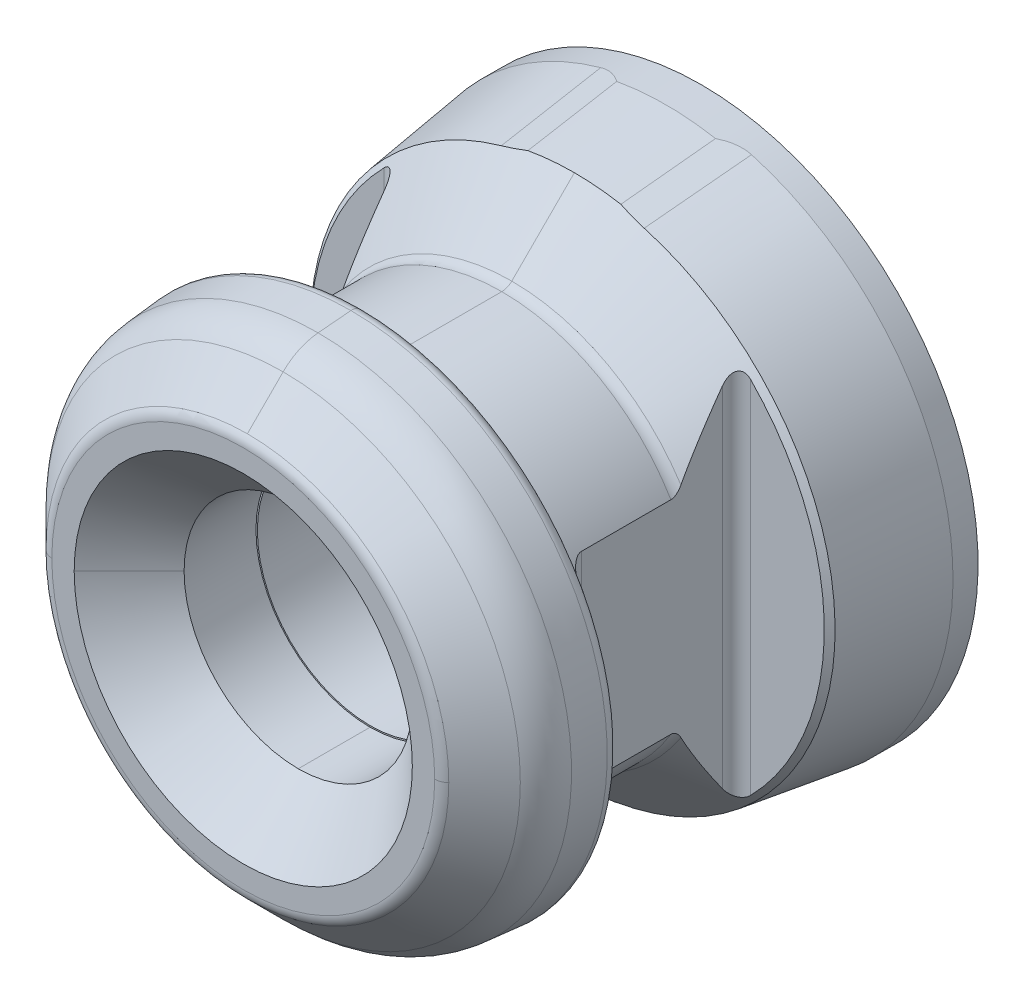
ISO-10303-21;
HEADER;
FILE_DESCRIPTION(('STEP AP214'),'2;1');
FILE_NAME('part.step','',(''),(''),'','','');
FILE_SCHEMA(('AUTOMOTIVE_DESIGN { 1 0 10303 214 1 1 1 1 }'));
ENDSEC;
DATA;
#1=APPLICATION_CONTEXT('core data for automotive mechanical design processes');
#2=APPLICATION_PROTOCOL_DEFINITION('international standard','automotive_design',2000,#1);
#3=PRODUCT_CONTEXT('',#1,'mechanical');
#4=PRODUCT('Part','Part','',(#3));
#5=PRODUCT_RELATED_PRODUCT_CATEGORY('part','',(#4));
#6=PRODUCT_DEFINITION_FORMATION('','',#4);
#7=PRODUCT_DEFINITION_CONTEXT('part definition',#1,'design');
#8=PRODUCT_DEFINITION('design','',#6,#7);
#9=PRODUCT_DEFINITION_SHAPE('','',#8);
#10=(LENGTH_UNIT() NAMED_UNIT(*) SI_UNIT(.MILLI.,.METRE.));
#11=(NAMED_UNIT(*) PLANE_ANGLE_UNIT() SI_UNIT($,.RADIAN.));
#12=(NAMED_UNIT(*) SI_UNIT($,.STERADIAN.) SOLID_ANGLE_UNIT());
#13=UNCERTAINTY_MEASURE_WITH_UNIT(LENGTH_MEASURE(1.E-05),#10,'distance_accuracy_value','');
#14=(GEOMETRIC_REPRESENTATION_CONTEXT(3) GLOBAL_UNCERTAINTY_ASSIGNED_CONTEXT((#13)) GLOBAL_UNIT_ASSIGNED_CONTEXT((#10,
#11,#12)) REPRESENTATION_CONTEXT('',''));
#15=CARTESIAN_POINT('',(0.,0.,0.));
#16=DIRECTION('',(0.,0.,1.));
#17=DIRECTION('',(1.,0.,0.));
#18=AXIS2_PLACEMENT_3D('',#15,#16,#17);
#19=CARTESIAN_POINT('',(0.,0.,0.));
#20=DIRECTION('',(0.,0.,-1.));
#21=DIRECTION('',(0.,-1.,0.));
#22=AXIS2_PLACEMENT_3D('',#19,#20,#21);
#23=CONICAL_SURFACE('',#22,16.,1.0471975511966);
#24=CARTESIAN_POINT('',(0.,0.,0.5));
#25=DIRECTION('',(0.,0.,-1.));
#26=DIRECTION('',(0.,-1.,0.));
#27=AXIS2_PLACEMENT_3D('',#24,#25,#26);
#28=CIRCLE('',#27,15.1339745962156);
#29=CARTESIAN_POINT('',(15.0823339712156,-1.24915533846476,0.5));
#30=VERTEX_POINT('',#29);
#31=CARTESIAN_POINT('',(0.,-15.1339745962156,0.5));
#32=VERTEX_POINT('',#31);
#33=EDGE_CURVE('E327',#30,#32,#28,.T.);
#34=ORIENTED_EDGE('',*,*,#33,.F.);
#35=CARTESIAN_POINT('',(15.082006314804,-1.24891456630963,0.5002));
#36=CARTESIAN_POINT('',(15.1632915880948,-1.30866825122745,0.450560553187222));
#37=CARTESIAN_POINT('',(15.2493311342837,-1.35969394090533,0.398486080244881));
#38=CARTESIAN_POINT('',(15.4261644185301,-1.44310692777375,0.292443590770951));
#39=CARTESIAN_POINT('',(15.516822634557,-1.4758586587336,0.238537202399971));
#40=CARTESIAN_POINT('',(15.6607649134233,-1.51335898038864,0.153739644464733));
#41=CARTESIAN_POINT('',(15.7128036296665,-1.52408521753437,0.123237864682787));
#42=CARTESIAN_POINT('',(15.8182473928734,-1.54023968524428,0.0617432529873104));
#43=CARTESIAN_POINT('',(15.871661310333,-1.54560415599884,0.0307488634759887));
#44=CARTESIAN_POINT('',(15.9252682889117,-1.54819739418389,-0.000200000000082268));
#45=B_SPLINE_CURVE_WITH_KNOTS('',3,(#35,#36,#37,#38,#39,#40,#41,#42,#43,#44),.UNSPECIFIED.,.F.,
.F.,(4,2,2,2,4),(0.,0.336717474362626,0.666455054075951,0.850038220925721,1.03577939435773),.UNSPECIFIED.);
#46=CARTESIAN_POINT('',(15.924921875,-1.54818063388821,0.));
#47=VERTEX_POINT('',#46);
#48=EDGE_CURVE('E28',#30,#47,#45,.T.);
#49=ORIENTED_EDGE('',*,*,#48,.T.);
#50=CARTESIAN_POINT('',(0.,0.,0.));
#51=DIRECTION('',(0.,0.,-1.));
#52=DIRECTION('',(0.,-1.,0.));
#53=AXIS2_PLACEMENT_3D('',#50,#51,#52);
#54=CIRCLE('',#53,16.);
#55=CARTESIAN_POINT('',(0.,-16.,0.));
#56=VERTEX_POINT('',#55);
#57=EDGE_CURVE('E325',#56,#47,#54,.F.);
#58=ORIENTED_EDGE('',*,*,#57,.F.);
#59=DIRECTION('',(0.,0.866025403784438,0.5));
#60=VECTOR('',#59,1.);
#61=CARTESIAN_POINT('',(0.,-16.,0.));
#62=LINE('',#61,#60);
#63=EDGE_CURVE('E337',#56,#32,#62,.T.);
#64=ORIENTED_EDGE('',*,*,#63,.T.);
#65=EDGE_LOOP('',(#34,#49,#58,#64));
#66=FACE_BOUND('',#65,.T.);
#67=ADVANCED_FACE('F14',(#66),#23,.F.);
#68=CARTESIAN_POINT('',(3.72354237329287,-22.9898449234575,16.0184965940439));
#69=DIRECTION('',(-0.987136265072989,-0.159881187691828,0.));
#70=DIRECTION('',(0.159881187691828,-0.987136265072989,0.));
#71=AXIS2_PLACEMENT_3D('',#68,#69,#70);
#72=PLANE('',#71);
#73=DIRECTION('',(0.,0.,1.));
#74=VECTOR('',#73,1.);
#75=CARTESIAN_POINT('',(3.14166533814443,-19.3972276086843,37.861773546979));
#76=LINE('',#75,#74);
#77=CARTESIAN_POINT('',(3.14166533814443,-19.3972276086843,1.77884243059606));
#78=VERTEX_POINT('',#77);
#79=CARTESIAN_POINT('',(3.14166533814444,-19.3972276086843,2.49037940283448));
#80=VERTEX_POINT('',#79);
#81=EDGE_CURVE('E1720',#78,#80,#76,.T.);
#82=ORIENTED_EDGE('',*,*,#81,.F.);
#83=DIRECTION('',(-0.0222511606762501,0.137382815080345,0.99026806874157));
#84=VECTOR('',#83,1.);
#85=CARTESIAN_POINT('',(3.18163563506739,-19.6440116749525,0.));
#86=LINE('',#85,#84);
#87=CARTESIAN_POINT('',(2.97679269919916,-18.3792731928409,9.11635224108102));
#88=VERTEX_POINT('',#87);
#89=EDGE_CURVE('E582',#88,#78,#86,.F.);
#90=ORIENTED_EDGE('',*,*,#89,.F.);
#91=DIRECTION('',(-0.113053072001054,0.698010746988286,0.707106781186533));
#92=VECTOR('',#91,1.);
#93=CARTESIAN_POINT('',(2.99539523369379,-18.4941287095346,9.));
#94=LINE('',#93,#92);
#95=CARTESIAN_POINT('',(2.9953952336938,-18.4941287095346,9.));
#96=VERTEX_POINT('',#95);
#97=EDGE_CURVE('E566',#96,#88,#94,.T.);
#98=ORIENTED_EDGE('',*,*,#97,.F.);
#99=DIRECTION('',(-0.0222511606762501,0.137382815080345,0.99026806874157));
#100=VECTOR('',#99,1.);
#101=CARTESIAN_POINT('',(2.9953952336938,-18.4941287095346,9.));
#102=LINE('',#101,#100);
#103=EDGE_CURVE('E581',#80,#96,#102,.T.);
#104=ORIENTED_EDGE('',*,*,#103,.F.);
#105=EDGE_LOOP('',(#82,#90,#98,#104));
#106=FACE_BOUND('',#105,.T.);
#107=ADVANCED_FACE('F481',(#106),#72,.F.);
#108=CARTESIAN_POINT('',(-3.72354237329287,-22.9898449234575,16.0184965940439));
#109=DIRECTION('',(0.987136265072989,-0.159881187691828,0.));
#110=DIRECTION('',(0.159881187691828,0.987136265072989,0.));
#111=AXIS2_PLACEMENT_3D('',#108,#109,#110);
#112=PLANE('',#111);
#113=DIRECTION('',(0.,0.,1.));
#114=VECTOR('',#113,1.);
#115=CARTESIAN_POINT('',(-3.14166533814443,-19.3972276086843,37.861773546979));
#116=LINE('',#115,#114);
#117=CARTESIAN_POINT('',(-3.14166533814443,-19.3972276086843,2.49037940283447));
#118=VERTEX_POINT('',#117);
#119=CARTESIAN_POINT('',(-3.14166533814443,-19.3972276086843,1.7788424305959));
#120=VERTEX_POINT('',#119);
#121=EDGE_CURVE('E36',#118,#120,#116,.F.);
#122=ORIENTED_EDGE('',*,*,#121,.F.);
#123=DIRECTION('',(0.0222511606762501,0.137382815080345,0.99026806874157));
#124=VECTOR('',#123,1.);
#125=CARTESIAN_POINT('',(-2.99539523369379,-18.4941287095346,9.));
#126=LINE('',#125,#124);
#127=CARTESIAN_POINT('',(-2.99539523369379,-18.4941287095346,9.));
#128=VERTEX_POINT('',#127);
#129=EDGE_CURVE('E588',#128,#118,#126,.F.);
#130=ORIENTED_EDGE('',*,*,#129,.F.);
#131=DIRECTION('',(0.113053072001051,0.698010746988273,0.707106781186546));
#132=VECTOR('',#131,1.);
#133=CARTESIAN_POINT('',(-2.28516474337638,-14.1090332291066,13.442239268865));
#134=LINE('',#133,#132);
#135=CARTESIAN_POINT('',(-2.97679269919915,-18.3792731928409,9.11635224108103));
#136=VERTEX_POINT('',#135);
#137=EDGE_CURVE('E576',#136,#128,#134,.F.);
#138=ORIENTED_EDGE('',*,*,#137,.F.);
#139=DIRECTION('',(0.0222511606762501,0.137382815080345,0.99026806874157));
#140=VECTOR('',#139,1.);
#141=CARTESIAN_POINT('',(-3.18163563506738,-19.6440116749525,0.));
#142=LINE('',#141,#140);
#143=EDGE_CURVE('E591',#120,#136,#142,.T.);
#144=ORIENTED_EDGE('',*,*,#143,.F.);
#145=EDGE_LOOP('',(#122,#130,#138,#144));
#146=FACE_BOUND('',#145,.T.);
#147=ADVANCED_FACE('F403',(#146),#112,.F.);
#148=CARTESIAN_POINT('',(-59.352776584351,209.748265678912,27.6173860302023));
#149=DIRECTION('',(-0.0378940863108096,0.133914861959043,-0.99026806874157));
#150=DIRECTION('',(0.,-0.990979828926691,-0.134011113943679));
#151=AXIS2_PLACEMENT_3D('',#148,#149,#150);
#152=CYLINDRICAL_SURFACE('',#151,200.);
#153=CARTESIAN_POINT('',(-5.35030685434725,18.9075835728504,1.77884243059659));
#154=CARTESIAN_POINT('',(-5.26362556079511,18.9321186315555,1.77879174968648));
#155=CARTESIAN_POINT('',(-5.17685209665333,18.9560218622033,1.78369252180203));
#156=CARTESIAN_POINT('',(-5.00413106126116,19.0023445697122,1.8029014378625));
#157=CARTESIAN_POINT('',(-4.91818220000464,19.0247668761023,1.81719103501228));
#158=CARTESIAN_POINT('',(-4.66724455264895,19.08843836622,1.8724039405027));
#159=CARTESIAN_POINT('',(-4.50432677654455,19.1274526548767,1.92573509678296));
#160=CARTESIAN_POINT('',(-4.19631003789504,19.1973298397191,2.05578584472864));
#161=CARTESIAN_POINT('',(-4.05073296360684,19.2284905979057,2.13128247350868));
#162=CARTESIAN_POINT('',(-3.7656360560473,19.2863686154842,2.30279966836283));
#163=CARTESIAN_POINT('',(-3.62638016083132,19.3129457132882,2.39931252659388));
#164=CARTESIAN_POINT('',(-3.49249292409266,19.3371402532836,2.50231029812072));
#165=B_SPLINE_CURVE_WITH_KNOTS('',3,(#153,#154,#155,#156,#157,#158,#159,#160,#161,#162,#163,
#164),.UNSPECIFIED.,.F.,.F.,(4,2,2,2,2,4),(0.,0.26997630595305,0.539420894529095,
1.06352052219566,1.56287867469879,2.07551291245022),.UNSPECIFIED.);
#166=CARTESIAN_POINT('',(-5.35030685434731,18.9075835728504,1.7788424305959));
#167=VERTEX_POINT('',#166);
#168=CARTESIAN_POINT('',(-3.50805017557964,19.3343239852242,2.49037940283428));
#169=VERTEX_POINT('',#168);
#170=EDGE_CURVE('E849',#167,#169,#165,.T.);
#171=ORIENTED_EDGE('',*,*,#170,.F.);
#172=DIRECTION('',(0.0378940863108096,-0.133914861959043,0.99026806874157));
#173=VECTOR('',#172,1.);
#174=CARTESIAN_POINT('',(-5.41837691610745,19.1481380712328,0.));
#175=LINE('',#174,#173);
#176=CARTESIAN_POINT('',(-5.06952608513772,17.9153253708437,9.11635224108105));
#177=VERTEX_POINT('',#176);
#178=EDGE_CURVE('E712',#177,#167,#175,.F.);
#179=ORIENTED_EDGE('',*,*,#178,.F.);
#180=CARTESIAN_POINT('',(-3.29802626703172,18.4425652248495,9.00000000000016));
#181=CARTESIAN_POINT('',(-3.44436377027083,18.3968598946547,9.01923512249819));
#182=CARTESIAN_POINT('',(-3.59113520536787,18.3515544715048,9.03614013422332));
#183=CARTESIAN_POINT('',(-3.88525739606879,18.2618453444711,9.06518730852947));
#184=CARTESIAN_POINT('',(-4.03260740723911,18.2174407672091,9.0773343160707));
#185=CARTESIAN_POINT('',(-4.32789927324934,18.1295411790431,9.09680259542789));
#186=CARTESIAN_POINT('',(-4.47584113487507,18.0860461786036,9.10412381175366));
#187=CARTESIAN_POINT('',(-4.77231557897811,17.9999729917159,9.11390388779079));
#188=CARTESIAN_POINT('',(-4.92084861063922,17.9573957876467,9.11635777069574));
#189=CARTESIAN_POINT('',(-5.06952608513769,17.9153253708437,9.11635224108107));
#190=B_SPLINE_CURVE_WITH_KNOTS('',3,(#180,#181,#182,#183,#184,#185,#186,#187,#188,#189),
.UNSPECIFIED.,.F.,.F.,(4,2,2,2,4),(0.,0.463518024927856,0.926562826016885,1.38961295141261,
1.85313629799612),.UNSPECIFIED.);
#191=CARTESIAN_POINT('',(-3.29802626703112,18.4425652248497,9.00000000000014));
#192=VERTEX_POINT('',#191);
#193=EDGE_CURVE('E378',#192,#177,#190,.T.);
#194=ORIENTED_EDGE('',*,*,#193,.F.);
#195=CARTESIAN_POINT('',(-3.53107767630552,19.4317778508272,1.77884243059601));
#196=CARTESIAN_POINT('',(-3.49211486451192,19.2669435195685,2.98236950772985));
#197=CARTESIAN_POINT('',(-3.45321250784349,19.1020919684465,4.1858961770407));
#198=CARTESIAN_POINT('',(-3.37552870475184,18.7723544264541,6.59294870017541));
#199=CARTESIAN_POINT('',(-3.33674725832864,18.6074684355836,7.79647455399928));
#200=CARTESIAN_POINT('',(-3.29802626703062,18.4425652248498,9.00000000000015));
#201=B_SPLINE_CURVE_WITH_KNOTS('',3,(#195,#196,#197,#198,#199,#200),.UNSPECIFIED.,.F.,.F.,(4,2,
4),(0.,3.64616138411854,7.29232276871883),.UNSPECIFIED.);
#202=EDGE_CURVE('E371',#169,#192,#201,.T.);
#203=ORIENTED_EDGE('',*,*,#202,.F.);
#204=EDGE_LOOP('',(#171,#179,#194,#203));
#205=FACE_BOUND('',#204,.T.);
#206=ADVANCED_FACE('F366',(#205),#152,.F.);
#207=CARTESIAN_POINT('',(0.,0.,1.77884243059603));
#208=DIRECTION('',(0.,0.,-1.));
#209=DIRECTION('',(0.,-1.,0.));
#210=AXIS2_PLACEMENT_3D('',#207,#208,#209);
#211=CONICAL_SURFACE('',#210,19.75,0.139626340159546);
#212=CARTESIAN_POINT('',(3.29802626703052,18.4425652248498,9.00000000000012));
#213=CARTESIAN_POINT('',(3.33674725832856,18.6074684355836,7.79647455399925));
#214=CARTESIAN_POINT('',(3.37552870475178,18.7723544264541,6.59294870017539));
#215=CARTESIAN_POINT('',(3.45321250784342,19.1020919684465,4.18589617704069));
#216=CARTESIAN_POINT('',(3.49211486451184,19.2669435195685,2.98236950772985));
#217=CARTESIAN_POINT('',(3.53107767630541,19.4317778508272,1.77884243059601));
#218=B_SPLINE_CURVE_WITH_KNOTS('',3,(#212,#213,#214,#215,#216,#217),.UNSPECIFIED.,.F.,.F.,(4,2,
4),(0.,3.64616138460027,7.2923227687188),.UNSPECIFIED.);
#219=CARTESIAN_POINT('',(3.29802626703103,18.4425652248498,9.));
#220=VERTEX_POINT('',#219);
#221=CARTESIAN_POINT('',(3.50805017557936,19.3343239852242,2.49037940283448));
#222=VERTEX_POINT('',#221);
#223=EDGE_CURVE('E342',#220,#222,#218,.T.);
#224=ORIENTED_EDGE('',*,*,#223,.T.);
#225=CARTESIAN_POINT('',(0.,0.,2.49037940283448));
#226=DIRECTION('',(0.,0.,-1.));
#227=DIRECTION('',(0.,1.,0.));
#228=AXIS2_PLACEMENT_3D('',#225,#226,#227);
#229=CIRCLE('',#228,19.65);
#230=EDGE_CURVE('E1718',#222,#169,#229,.F.);
#231=ORIENTED_EDGE('',*,*,#230,.T.);
#232=ORIENTED_EDGE('',*,*,#202,.T.);
#233=CARTESIAN_POINT('',(0.,0.,9.00000000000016));
#234=DIRECTION('',(0.,0.,-1.));
#235=DIRECTION('',(0.,-1.,0.));
#236=AXIS2_PLACEMENT_3D('',#233,#234,#235);
#237=CIRCLE('',#236,18.7351324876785);
#238=CARTESIAN_POINT('',(0.,18.7351324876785,9.));
#239=VERTEX_POINT('',#238);
#240=EDGE_CURVE('E377',#192,#239,#237,.T.);
#241=ORIENTED_EDGE('',*,*,#240,.T.);
#242=CARTESIAN_POINT('',(0.,0.,9.));
#243=DIRECTION('',(0.,0.,-1.));
#244=DIRECTION('',(0.,-1.,0.));
#245=AXIS2_PLACEMENT_3D('',#242,#243,#244);
#246=CIRCLE('',#245,18.7351324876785);
#247=EDGE_CURVE('E745',#239,#220,#246,.T.);
#248=ORIENTED_EDGE('',*,*,#247,.T.);
#249=EDGE_LOOP('',(#224,#231,#232,#241,#248));
#250=FACE_BOUND('',#249,.T.);
#251=ADVANCED_FACE('F362',(#250),#211,.T.);
#252=CARTESIAN_POINT('',(59.352776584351,209.748265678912,27.6173860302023));
#253=DIRECTION('',(0.0378940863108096,0.133914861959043,-0.99026806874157));
#254=DIRECTION('',(0.,-0.990979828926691,-0.134011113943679));
#255=AXIS2_PLACEMENT_3D('',#252,#253,#254);
#256=CYLINDRICAL_SURFACE('',#255,200.);
#257=CARTESIAN_POINT('',(3.49249292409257,19.3371402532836,2.50231029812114));
#258=CARTESIAN_POINT('',(3.63466344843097,19.3114539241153,2.39290220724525));
#259=CARTESIAN_POINT('',(3.78306734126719,19.2830376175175,2.29075048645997));
#260=CARTESIAN_POINT('',(4.08721057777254,19.2208418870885,2.11116703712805));
#261=CARTESIAN_POINT('',(4.24263049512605,19.1872338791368,2.03312605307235));
#262=CARTESIAN_POINT('',(4.55282091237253,19.1159016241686,1.90939439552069));
#263=CARTESIAN_POINT('',(4.706922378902,19.0786103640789,1.86187058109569));
#264=CARTESIAN_POINT('',(4.94368785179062,19.0181325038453,1.8128035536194));
#265=CARTESIAN_POINT('',(5.02463308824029,18.9969101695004,1.80013882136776));
#266=CARTESIAN_POINT('',(5.18718313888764,18.9531729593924,1.7831319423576));
#267=CARTESIAN_POINT('',(5.26878880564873,18.930656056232,1.77880323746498));
#268=CARTESIAN_POINT('',(5.35030685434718,18.9075835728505,1.77884243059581));
#269=B_SPLINE_CURVE_WITH_KNOTS('',3,(#257,#258,#259,#260,#261,#262,#263,#264,#265,#266,#267,
#268),.UNSPECIFIED.,.F.,.F.,(4,2,2,2,2,4),(0.,0.544751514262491,1.07433069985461,
1.56804012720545,1.82155983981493,2.07548801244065),.UNSPECIFIED.);
#270=CARTESIAN_POINT('',(5.35030685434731,18.9075835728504,1.77884243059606));
#271=VERTEX_POINT('',#270);
#272=EDGE_CURVE('E598',#222,#271,#269,.T.);
#273=ORIENTED_EDGE('',*,*,#272,.F.);
#274=ORIENTED_EDGE('',*,*,#223,.F.);
#275=CARTESIAN_POINT('',(5.06952608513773,17.9153253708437,9.11635224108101));
#276=CARTESIAN_POINT('',(4.92084861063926,17.9573957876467,9.11635777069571));
#277=CARTESIAN_POINT('',(4.77231557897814,17.9999729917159,9.11390388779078));
#278=CARTESIAN_POINT('',(4.4758411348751,18.0860461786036,9.10412381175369));
#279=CARTESIAN_POINT('',(4.32789927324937,18.1295411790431,9.09680259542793));
#280=CARTESIAN_POINT('',(4.03260740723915,18.2174407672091,9.07733431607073));
#281=CARTESIAN_POINT('',(3.88525739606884,18.2618453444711,9.06518730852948));
#282=CARTESIAN_POINT('',(3.59113520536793,18.3515544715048,9.03614013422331));
#283=CARTESIAN_POINT('',(3.4443637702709,18.3968598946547,9.01923512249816));
#284=CARTESIAN_POINT('',(3.29802626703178,18.4425652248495,9.00000000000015));
#285=B_SPLINE_CURVE_WITH_KNOTS('',3,(#275,#276,#277,#278,#279,#280,#281,#282,#283,#284),
.UNSPECIFIED.,.F.,.F.,(4,2,2,2,4),(0.,0.4635233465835,0.926573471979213,1.38961827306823,
1.85313629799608),.UNSPECIFIED.);
#286=CARTESIAN_POINT('',(5.06952608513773,17.9153253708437,9.11635224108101));
#287=VERTEX_POINT('',#286);
#288=EDGE_CURVE('E352',#287,#220,#285,.T.);
#289=ORIENTED_EDGE('',*,*,#288,.F.);
#290=DIRECTION('',(-0.0378940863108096,-0.133914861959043,0.99026806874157));
#291=VECTOR('',#290,1.);
#292=CARTESIAN_POINT('',(5.41837691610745,19.1481380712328,0.));
#293=LINE('',#292,#291);
#294=EDGE_CURVE('E351',#271,#287,#293,.T.);
#295=ORIENTED_EDGE('',*,*,#294,.F.);
#296=EDGE_LOOP('',(#273,#274,#289,#295));
#297=FACE_BOUND('',#296,.T.);
#298=ADVANCED_FACE('F359',(#297),#256,.F.);
#299=CARTESIAN_POINT('',(0.,0.,1.06730545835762));
#300=DIRECTION('',(0.,0.,-1.));
#301=DIRECTION('',(0.,-1.,0.));
#302=AXIS2_PLACEMENT_3D('',#299,#300,#301);
#303=CONICAL_SURFACE('',#302,19.75,0.139626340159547);
#304=ORIENTED_EDGE('',*,*,#89,.T.);
#305=CARTESIAN_POINT('',(0.,0.,1.77884243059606));
#306=DIRECTION('',(0.,0.,-1.));
#307=DIRECTION('',(0.,1.,0.));
#308=AXIS2_PLACEMENT_3D('',#305,#306,#307);
#309=CIRCLE('',#308,19.65);
#310=EDGE_CURVE('E862',#78,#271,#309,.F.);
#311=ORIENTED_EDGE('',*,*,#310,.T.);
#312=ORIENTED_EDGE('',*,*,#294,.T.);
#313=CARTESIAN_POINT('',(0.,0.,9.116352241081));
#314=DIRECTION('',(0.,0.,-1.));
#315=DIRECTION('',(0.,-1.,0.));
#316=AXIS2_PLACEMENT_3D('',#313,#314,#315);
#317=CIRCLE('',#316,18.6187802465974);
#318=EDGE_CURVE('E710',#287,#88,#317,.T.);
#319=ORIENTED_EDGE('',*,*,#318,.T.);
#320=EDGE_LOOP('',(#304,#311,#312,#319));
#321=FACE_BOUND('',#320,.T.);
#322=ADVANCED_FACE('F1501',(#321),#303,.T.);
#323=CARTESIAN_POINT('',(0.,0.,1.77884243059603));
#324=DIRECTION('',(0.,0.,-1.));
#325=DIRECTION('',(0.,-1.,0.));
#326=AXIS2_PLACEMENT_3D('',#323,#324,#325);
#327=CONICAL_SURFACE('',#326,19.75,0.139626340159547);
#328=DIRECTION('',(0.,0.139173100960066,0.99026806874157));
#329=VECTOR('',#328,1.);
#330=CARTESIAN_POINT('',(0.,-18.7351324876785,9.));
#331=LINE('',#330,#329);
#332=CARTESIAN_POINT('',(0.,-19.65,2.49037940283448));
#333=VERTEX_POINT('',#332);
#334=CARTESIAN_POINT('',(0.,-18.7351324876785,9.));
#335=VERTEX_POINT('',#334);
#336=EDGE_CURVE('E583',#333,#335,#331,.T.);
#337=ORIENTED_EDGE('',*,*,#336,.F.);
#338=CARTESIAN_POINT('',(0.,0.,2.49037940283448));
#339=DIRECTION('',(0.,0.,-1.));
#340=DIRECTION('',(0.,1.,0.));
#341=AXIS2_PLACEMENT_3D('',#338,#339,#340);
#342=CIRCLE('',#341,19.65);
#343=EDGE_CURVE('E1722',#333,#80,#342,.F.);
#344=ORIENTED_EDGE('',*,*,#343,.T.);
#345=ORIENTED_EDGE('',*,*,#103,.T.);
#346=CARTESIAN_POINT('',(0.,0.,9.));
#347=DIRECTION('',(0.,0.,-1.));
#348=DIRECTION('',(0.,-1.,0.));
#349=AXIS2_PLACEMENT_3D('',#346,#347,#348);
#350=CIRCLE('',#349,18.7351324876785);
#351=EDGE_CURVE('E578',#96,#335,#350,.T.);
#352=ORIENTED_EDGE('',*,*,#351,.T.);
#353=EDGE_LOOP('',(#337,#344,#345,#352));
#354=FACE_BOUND('',#353,.T.);
#355=ADVANCED_FACE('F1491',(#354),#327,.T.);
#356=CARTESIAN_POINT('',(0.,0.,1.77884243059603));
#357=DIRECTION('',(0.,0.,-1.));
#358=DIRECTION('',(0.,-1.,0.));
#359=AXIS2_PLACEMENT_3D('',#356,#357,#358);
#360=CONICAL_SURFACE('',#359,19.75,0.139626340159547);
#361=ORIENTED_EDGE('',*,*,#129,.T.);
#362=CARTESIAN_POINT('',(0.,0.,2.49037940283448));
#363=DIRECTION('',(0.,0.,-1.));
#364=DIRECTION('',(0.,1.,0.));
#365=AXIS2_PLACEMENT_3D('',#362,#363,#364);
#366=CIRCLE('',#365,19.65);
#367=EDGE_CURVE('E1646',#118,#333,#366,.F.);
#368=ORIENTED_EDGE('',*,*,#367,.T.);
#369=ORIENTED_EDGE('',*,*,#336,.T.);
#370=CARTESIAN_POINT('',(0.,0.,9.));
#371=DIRECTION('',(0.,0.,-1.));
#372=DIRECTION('',(0.,-1.,0.));
#373=AXIS2_PLACEMENT_3D('',#370,#371,#372);
#374=CIRCLE('',#373,18.7351324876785);
#375=EDGE_CURVE('E585',#335,#128,#374,.T.);
#376=ORIENTED_EDGE('',*,*,#375,.T.);
#377=EDGE_LOOP('',(#361,#368,#369,#376));
#378=FACE_BOUND('',#377,.T.);
#379=ADVANCED_FACE('F1482',(#378),#360,.T.);
#380=CARTESIAN_POINT('',(0.,0.,1.06730545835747));
#381=DIRECTION('',(0.,0.,-1.));
#382=DIRECTION('',(0.,-1.,0.));
#383=AXIS2_PLACEMENT_3D('',#380,#381,#382);
#384=CONICAL_SURFACE('',#383,19.75,0.139626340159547);
#385=ORIENTED_EDGE('',*,*,#178,.T.);
#386=CARTESIAN_POINT('',(0.,0.,1.7788424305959));
#387=DIRECTION('',(0.,0.,-1.));
#388=DIRECTION('',(0.,1.,0.));
#389=AXIS2_PLACEMENT_3D('',#386,#387,#388);
#390=CIRCLE('',#389,19.65);
#391=EDGE_CURVE('E832',#167,#120,#390,.F.);
#392=ORIENTED_EDGE('',*,*,#391,.T.);
#393=ORIENTED_EDGE('',*,*,#143,.T.);
#394=CARTESIAN_POINT('',(0.,0.,9.11635224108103));
#395=DIRECTION('',(0.,0.,-1.));
#396=DIRECTION('',(0.,-1.,0.));
#397=AXIS2_PLACEMENT_3D('',#394,#395,#396);
#398=CIRCLE('',#397,18.6187802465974);
#399=EDGE_CURVE('E715',#136,#177,#398,.T.);
#400=ORIENTED_EDGE('',*,*,#399,.T.);
#401=EDGE_LOOP('',(#385,#392,#393,#400));
#402=FACE_BOUND('',#401,.T.);
#403=ADVANCED_FACE('F675',(#402),#384,.T.);
#404=CARTESIAN_POINT('',(0.,20.,0.));
#405=DIRECTION('',(0.,0.,-1.));
#406=DIRECTION('',(0.,-1.,0.));
#407=AXIS2_PLACEMENT_3D('',#404,#405,#406);
#408=PLANE('',#407);
#409=CARTESIAN_POINT('',(16.,0.,0.));
#410=DIRECTION('',(0.,0.,-1.));
#411=DIRECTION('',(0.,1.,0.));
#412=AXIS2_PLACEMENT_3D('',#409,#410,#411);
#413=CIRCLE('',#412,1.55);
#414=CARTESIAN_POINT('',(15.924921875,1.54818063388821,0.));
#415=VERTEX_POINT('',#414);
#416=EDGE_CURVE('E313',#415,#47,#413,.T.);
#417=ORIENTED_EDGE('',*,*,#416,.F.);
#418=CARTESIAN_POINT('',(0.,16.,0.));
#419=VERTEX_POINT('',#418);
#420=EDGE_CURVE('E335',#415,#419,#54,.F.);
#421=ORIENTED_EDGE('',*,*,#420,.T.);
#422=CARTESIAN_POINT('',(0.,0.,0.));
#423=DIRECTION('',(0.,0.,-1.));
#424=DIRECTION('',(0.,-1.,0.));
#425=AXIS2_PLACEMENT_3D('',#422,#423,#424);
#426=CIRCLE('',#425,16.);
#427=EDGE_CURVE('E334',#419,#56,#426,.F.);
#428=ORIENTED_EDGE('',*,*,#427,.T.);
#429=ORIENTED_EDGE('',*,*,#57,.T.);
#430=EDGE_LOOP('',(#417,#421,#428,#429));
#431=FACE_BOUND('',#430,.T.);
#432=CARTESIAN_POINT('',(0.,0.,0.));
#433=DIRECTION('',(0.,0.,-1.));
#434=DIRECTION('',(0.,1.,0.));
#435=AXIS2_PLACEMENT_3D('',#432,#433,#434);
#436=CIRCLE('',#435,19.65);
#437=CARTESIAN_POINT('',(0.,19.65,0.));
#438=VERTEX_POINT('',#437);
#439=EDGE_CURVE('E328',#438,#438,#436,.T.);
#440=ORIENTED_EDGE('',*,*,#439,.T.);
#441=EDGE_LOOP('',(#440));
#442=FACE_BOUND('',#441,.T.);
#443=ADVANCED_FACE('F331',(#431,#442),#408,.T.);
#444=CARTESIAN_POINT('',(20.2702831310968,-19.75,9.5));
#445=DIRECTION('',(0.,0.,-1.));
#446=DIRECTION('',(-1.,0.,0.));
#447=AXIS2_PLACEMENT_3D('',#444,#445,#446);
#448=PLANE('',#447);
#449=DIRECTION('',(0.,1.,0.));
#450=VECTOR('',#449,1.);
#451=CARTESIAN_POINT('',(13.,-19.75,9.5));
#452=LINE('',#451,#450);
#453=CARTESIAN_POINT('',(13.,12.787496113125,9.5));
#454=VERTEX_POINT('',#453);
#455=CARTESIAN_POINT('',(13.,-12.787496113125,9.5));
#456=VERTEX_POINT('',#455);
#457=EDGE_CURVE('E569',#454,#456,#452,.F.);
#458=ORIENTED_EDGE('',*,*,#457,.T.);
#459=CARTESIAN_POINT('',(0.,0.,9.5));
#460=DIRECTION('',(0.,0.,-1.));
#461=DIRECTION('',(0.,-1.,0.));
#462=AXIS2_PLACEMENT_3D('',#459,#460,#461);
#463=CIRCLE('',#462,18.2351324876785);
#464=EDGE_CURVE('E468',#454,#456,#463,.T.);
#465=ORIENTED_EDGE('',*,*,#464,.F.);
#466=EDGE_LOOP('',(#458,#465));
#467=FACE_BOUND('',#466,.T.);
#468=ADVANCED_FACE('F16',(#467),#448,.F.);
#469=CARTESIAN_POINT('',(13.,-19.75,10.5));
#470=DIRECTION('',(0.,1.,0.));
#471=DIRECTION('',(-1.,0.,0.));
#472=AXIS2_PLACEMENT_3D('',#469,#470,#471);
#473=CYLINDRICAL_SURFACE('',#472,1.);
#474=DIRECTION('',(0.,1.,0.));
#475=VECTOR('',#474,1.);
#476=CARTESIAN_POINT('',(12.,-19.75,10.5));
#477=LINE('',#476,#475);
#478=CARTESIAN_POINT('',(12.,12.3713294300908,10.5));
#479=VERTEX_POINT('',#478);
#480=CARTESIAN_POINT('',(12.,-12.3713294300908,10.5));
#481=VERTEX_POINT('',#480);
#482=EDGE_CURVE('E755',#479,#481,#477,.F.);
#483=ORIENTED_EDGE('',*,*,#482,.T.);
#484=CARTESIAN_POINT('',(13.,-12.787496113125,9.5));
#485=CARTESIAN_POINT('',(12.9672028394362,-12.8207908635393,9.5000397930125));
#486=CARTESIAN_POINT('',(12.9329958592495,-12.8530479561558,9.50161981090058));
#487=CARTESIAN_POINT('',(12.8613649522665,-12.9143372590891,9.50897988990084));
#488=CARTESIAN_POINT('',(12.8239003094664,-12.9433135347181,9.51482289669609));
#489=CARTESIAN_POINT('',(12.7554257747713,-12.9896497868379,9.52989608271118));
#490=CARTESIAN_POINT('',(12.7249567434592,-13.0081413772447,9.53801380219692));
#491=CARTESIAN_POINT('',(12.6630169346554,-13.0406957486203,9.55793161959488));
#492=CARTESIAN_POINT('',(12.6315521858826,-13.0547810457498,9.56971236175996));
#493=CARTESIAN_POINT('',(12.5742151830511,-13.0753042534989,9.59473990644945));
#494=CARTESIAN_POINT('',(12.5483861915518,-13.0826752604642,9.60731133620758));
#495=CARTESIAN_POINT('',(12.4972541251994,-13.0931709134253,9.63507733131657));
#496=CARTESIAN_POINT('',(12.4719510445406,-13.0962956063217,9.65027186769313));
#497=CARTESIAN_POINT('',(12.4226618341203,-13.0980450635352,9.68295900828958));
#498=CARTESIAN_POINT('',(12.3986774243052,-13.0966640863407,9.70045451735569));
#499=CARTESIAN_POINT('',(12.3527485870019,-13.0895755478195,9.73715532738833));
#500=CARTESIAN_POINT('',(12.3308053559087,-13.0838654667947,9.7563616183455));
#501=CARTESIAN_POINT('',(12.2847389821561,-13.06693408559,9.8002661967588));
#502=CARTESIAN_POINT('',(12.2612235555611,-13.0547667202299,9.82523302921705));
#503=CARTESIAN_POINT('',(12.2180029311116,-13.0259459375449,9.87582588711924));
#504=CARTESIAN_POINT('',(12.1983027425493,-13.0092866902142,9.90145272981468));
#505=CARTESIAN_POINT('',(12.1536083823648,-12.9635457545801,9.96539110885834));
#506=CARTESIAN_POINT('',(12.1307948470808,-12.9323895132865,10.0037254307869));
#507=CARTESIAN_POINT('',(12.0916549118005,-12.8650775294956,10.0795874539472));
#508=CARTESIAN_POINT('',(12.0753713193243,-12.8288908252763,10.1171083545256));
#509=CARTESIAN_POINT('',(12.0502453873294,-12.7589431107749,10.1852362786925));
#510=CARTESIAN_POINT('',(12.040654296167,-12.7256289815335,10.2160379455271));
#511=CARTESIAN_POINT('',(12.0247716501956,-12.6572421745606,10.2765931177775));
#512=CARTESIAN_POINT('',(12.0184845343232,-12.622167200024,10.3063451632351));
#513=CARTESIAN_POINT('',(12.0088626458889,-12.5515836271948,10.3640470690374));
#514=CARTESIAN_POINT('',(12.0054617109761,-12.516104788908,10.392022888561));
#515=CARTESIAN_POINT('',(12.001040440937,-12.444306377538,10.4468362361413));
#516=CARTESIAN_POINT('',(12.0000126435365,-12.4079898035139,10.4736770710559));
#517=CARTESIAN_POINT('',(12.,-12.3713294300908,10.5));
#518=B_SPLINE_CURVE_WITH_KNOTS('',3,(#484,#485,#486,#487,#488,#489,#490,#491,#492,#493,#494,
#495,#496,#497,#498,#499,#500,#501,#502,#503,#504,#505,#506,#507,#508,#509,#510,#511,#512,#513,
#514,#515,#516,#517),.UNSPECIFIED.,.F.,.F.,(4,2,2,2,2,2,2,2,2,2,2,2,2,2,2,2,4),(0.,
0.140550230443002,0.283218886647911,0.392504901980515,0.501222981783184,0.589810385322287,
0.678396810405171,0.767096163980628,0.855847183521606,0.964420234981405,1.07313488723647,
1.23546477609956,1.39884208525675,1.53778008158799,1.67690426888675,1.81274571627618,
1.94815942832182),.UNSPECIFIED.);
#519=EDGE_CURVE('E453',#456,#481,#518,.T.);
#520=ORIENTED_EDGE('',*,*,#519,.F.);
#521=ORIENTED_EDGE('',*,*,#457,.F.);
#522=CARTESIAN_POINT('',(12.,12.3713294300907,10.5));
#523=CARTESIAN_POINT('',(12.0000268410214,12.4149754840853,10.4686535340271));
#524=CARTESIAN_POINT('',(12.0014766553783,12.4581560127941,10.4365676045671));
#525=CARTESIAN_POINT('',(12.0078332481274,12.543399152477,10.370680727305));
#526=CARTESIAN_POINT('',(12.0127641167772,12.5854518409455,10.3368693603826));
#527=CARTESIAN_POINT('',(12.0268435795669,12.6684147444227,10.2670721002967));
#528=CARTESIAN_POINT('',(12.0360710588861,12.7092877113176,10.2310569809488));
#529=CARTESIAN_POINT('',(12.0596466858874,12.7880418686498,10.1576255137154));
#530=CARTESIAN_POINT('',(12.0739784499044,12.8259321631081,10.1202139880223));
#531=CARTESIAN_POINT('',(12.1038008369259,12.8868979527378,10.0553682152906));
#532=CARTESIAN_POINT('',(12.1177129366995,12.9110546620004,10.0282331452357));
#533=CARTESIAN_POINT('',(12.1491515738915,12.9564064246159,9.97364793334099));
#534=CARTESIAN_POINT('',(12.1666700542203,12.9776079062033,9.94619862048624));
#535=CARTESIAN_POINT('',(12.2060771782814,13.0162917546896,9.89102512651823));
#536=CARTESIAN_POINT('',(12.2280194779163,13.0337224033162,9.86330198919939));
#537=CARTESIAN_POINT('',(12.2763978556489,13.0630174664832,9.80883034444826));
#538=CARTESIAN_POINT('',(12.3028236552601,13.0748943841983,9.78207977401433));
#539=CARTESIAN_POINT('',(12.3524248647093,13.0894483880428,9.73746762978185));
#540=CARTESIAN_POINT('',(12.3746759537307,13.0937096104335,9.7190951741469));
#541=CARTESIAN_POINT('',(12.4209599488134,13.097962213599,9.68418721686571));
#542=CARTESIAN_POINT('',(12.4449919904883,13.0979556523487,9.66765083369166));
#543=CARTESIAN_POINT('',(12.4941154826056,13.0936255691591,9.63691204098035));
#544=CARTESIAN_POINT('',(12.5192065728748,13.089303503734,9.62270884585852));
#545=CARTESIAN_POINT('',(12.5696902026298,13.0766921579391,9.59687240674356));
#546=CARTESIAN_POINT('',(12.5950828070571,13.0684020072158,9.58523972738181));
#547=CARTESIAN_POINT('',(12.6539113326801,13.0451233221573,9.56109587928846));
#548=CARTESIAN_POINT('',(12.687228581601,13.0288260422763,9.54956761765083));
#549=CARTESIAN_POINT('',(12.752542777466,12.9916383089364,9.53049906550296));
#550=CARTESIAN_POINT('',(12.7845322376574,12.9707251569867,9.52297913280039));
#551=CARTESIAN_POINT('',(12.8485966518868,12.9242322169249,9.51095631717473));
#552=CARTESIAN_POINT('',(12.8805569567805,12.8984451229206,9.50666631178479));
#553=CARTESIAN_POINT('',(12.9420004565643,12.8445256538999,9.50122056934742));
#554=CARTESIAN_POINT('',(12.9715106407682,12.8164284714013,9.50002446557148));
#555=CARTESIAN_POINT('',(13.,12.787496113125,9.5));
#556=B_SPLINE_CURVE_WITH_KNOTS('',3,(#522,#523,#524,#525,#526,#527,#528,#529,#530,#531,#532,
#533,#534,#535,#536,#537,#538,#539,#540,#541,#542,#543,#544,#545,#546,#547,#548,#549,#550,#551,
#552,#553,#554,#555),.UNSPECIFIED.,.F.,.F.,(4,2,2,2,2,2,2,2,2,2,2,2,2,2,2,2,4),(0.,
0.1612643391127,0.323655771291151,0.48915393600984,0.654125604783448,0.77061215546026,
0.886841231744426,1.00457547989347,1.12204338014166,1.2091603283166,1.29623526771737,
1.38328082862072,1.4703454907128,1.58621833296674,1.70267420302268,1.82625920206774,
1.94822343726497),.UNSPECIFIED.);
#557=EDGE_CURVE('E461',#479,#454,#556,.T.);
#558=ORIENTED_EDGE('',*,*,#557,.F.);
#559=EDGE_LOOP('',(#483,#520,#521,#558));
#560=FACE_BOUND('',#559,.T.);
#561=ADVANCED_FACE('F446',(#560),#473,.F.);
#562=CARTESIAN_POINT('',(-20.2702831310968,-19.75,9.5));
#563=DIRECTION('',(0.,0.,-1.));
#564=DIRECTION('',(-1.,0.,0.));
#565=AXIS2_PLACEMENT_3D('',#562,#563,#564);
#566=PLANE('',#565);
#567=DIRECTION('',(0.,1.,0.));
#568=VECTOR('',#567,1.);
#569=CARTESIAN_POINT('',(-13.,-19.75,9.5));
#570=LINE('',#569,#568);
#571=CARTESIAN_POINT('',(-13.,-12.787496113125,9.5));
#572=VERTEX_POINT('',#571);
#573=CARTESIAN_POINT('',(-13.,12.787496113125,9.5));
#574=VERTEX_POINT('',#573);
#575=EDGE_CURVE('E559',#572,#574,#570,.T.);
#576=ORIENTED_EDGE('',*,*,#575,.T.);
#577=CARTESIAN_POINT('',(0.,0.,9.5));
#578=DIRECTION('',(0.,0.,-1.));
#579=DIRECTION('',(0.,-1.,0.));
#580=AXIS2_PLACEMENT_3D('',#577,#578,#579);
#581=CIRCLE('',#580,18.2351324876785);
#582=EDGE_CURVE('E432',#572,#574,#581,.T.);
#583=ORIENTED_EDGE('',*,*,#582,.F.);
#584=EDGE_LOOP('',(#576,#583));
#585=FACE_BOUND('',#584,.T.);
#586=ADVANCED_FACE('F439',(#585),#566,.F.);
#587=CARTESIAN_POINT('',(-13.,-19.75,10.5));
#588=DIRECTION('',(0.,1.,0.));
#589=DIRECTION('',(-1.,0.,0.));
#590=AXIS2_PLACEMENT_3D('',#587,#588,#589);
#591=CYLINDRICAL_SURFACE('',#590,1.);
#592=DIRECTION('',(0.,1.,0.));
#593=VECTOR('',#592,1.);
#594=CARTESIAN_POINT('',(-12.,-19.75,10.5));
#595=LINE('',#594,#593);
#596=CARTESIAN_POINT('',(-12.,-12.3713294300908,10.5));
#597=VERTEX_POINT('',#596);
#598=CARTESIAN_POINT('',(-12.,12.3713294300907,10.5));
#599=VERTEX_POINT('',#598);
#600=EDGE_CURVE('E550',#597,#599,#595,.T.);
#601=ORIENTED_EDGE('',*,*,#600,.T.);
#602=CARTESIAN_POINT('',(-13.,12.787496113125,9.5));
#603=CARTESIAN_POINT('',(-12.9672028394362,12.8207908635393,9.5000397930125));
#604=CARTESIAN_POINT('',(-12.9329958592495,12.8530479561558,9.50161981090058));
#605=CARTESIAN_POINT('',(-12.8613649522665,12.9143372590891,9.50897988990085));
#606=CARTESIAN_POINT('',(-12.8239003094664,12.9433135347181,9.51482289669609));
#607=CARTESIAN_POINT('',(-12.7554257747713,12.9896497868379,9.52989608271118));
#608=CARTESIAN_POINT('',(-12.7249567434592,13.0081413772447,9.53801380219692));
#609=CARTESIAN_POINT('',(-12.6630169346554,13.0406957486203,9.55793161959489));
#610=CARTESIAN_POINT('',(-12.6315521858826,13.0547810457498,9.56971236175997));
#611=CARTESIAN_POINT('',(-12.5742151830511,13.0753042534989,9.59473990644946));
#612=CARTESIAN_POINT('',(-12.5483861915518,13.0826752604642,9.60731133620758));
#613=CARTESIAN_POINT('',(-12.4972541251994,13.0931709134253,9.63507733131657));
#614=CARTESIAN_POINT('',(-12.4719510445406,13.0962956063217,9.65027186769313));
#615=CARTESIAN_POINT('',(-12.4226618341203,13.0980450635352,9.68295900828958));
#616=CARTESIAN_POINT('',(-12.3986774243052,13.0966640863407,9.70045451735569));
#617=CARTESIAN_POINT('',(-12.3527485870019,13.0895755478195,9.73715532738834));
#618=CARTESIAN_POINT('',(-12.3308053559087,13.0838654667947,9.75636161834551));
#619=CARTESIAN_POINT('',(-12.2847389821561,13.06693408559,9.80026619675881));
#620=CARTESIAN_POINT('',(-12.2612235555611,13.0547667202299,9.82523302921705));
#621=CARTESIAN_POINT('',(-12.2180029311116,13.0259459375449,9.87582588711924));
#622=CARTESIAN_POINT('',(-12.1983027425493,13.0092866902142,9.90145272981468));
#623=CARTESIAN_POINT('',(-12.1536083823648,12.9635457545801,9.96539110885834));
#624=CARTESIAN_POINT('',(-12.1307948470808,12.9323895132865,10.0037254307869));
#625=CARTESIAN_POINT('',(-12.0916549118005,12.8650775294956,10.0795874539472));
#626=CARTESIAN_POINT('',(-12.0753713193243,12.8288908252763,10.1171083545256));
#627=CARTESIAN_POINT('',(-12.0502453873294,12.7589431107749,10.1852362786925));
#628=CARTESIAN_POINT('',(-12.040654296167,12.7256289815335,10.2160379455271));
#629=CARTESIAN_POINT('',(-12.0247716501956,12.6572421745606,10.2765931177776));
#630=CARTESIAN_POINT('',(-12.0184845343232,12.622167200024,10.3063451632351));
#631=CARTESIAN_POINT('',(-12.0088626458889,12.5515836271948,10.3640470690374));
#632=CARTESIAN_POINT('',(-12.0054617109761,12.5161047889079,10.392022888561));
#633=CARTESIAN_POINT('',(-12.001040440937,12.4443063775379,10.4468362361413));
#634=CARTESIAN_POINT('',(-12.0000126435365,12.4079898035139,10.4736770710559));
#635=CARTESIAN_POINT('',(-12.,12.3713294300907,10.5));
#636=B_SPLINE_CURVE_WITH_KNOTS('',3,(#602,#603,#604,#605,#606,#607,#608,#609,#610,#611,#612,
#613,#614,#615,#616,#617,#618,#619,#620,#621,#622,#623,#624,#625,#626,#627,#628,#629,#630,#631,
#632,#633,#634,#635),.UNSPECIFIED.,.F.,.F.,(4,2,2,2,2,2,2,2,2,2,2,2,2,2,2,2,4),(0.,
0.140550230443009,0.283218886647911,0.392504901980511,0.501222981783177,0.589810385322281,
0.678396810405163,0.76709616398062,0.855847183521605,0.964420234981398,1.07313488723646,
1.23546477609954,1.39884208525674,1.53778008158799,1.67690426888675,1.81274571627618,
1.94815942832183),.UNSPECIFIED.);
#637=EDGE_CURVE('E427',#574,#599,#636,.T.);
#638=ORIENTED_EDGE('',*,*,#637,.F.);
#639=ORIENTED_EDGE('',*,*,#575,.F.);
#640=CARTESIAN_POINT('',(-12.,-12.3713294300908,10.5));
#641=CARTESIAN_POINT('',(-12.0000268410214,-12.4149754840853,10.4686535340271));
#642=CARTESIAN_POINT('',(-12.0014766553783,-12.4581560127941,10.4365676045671));
#643=CARTESIAN_POINT('',(-12.0078332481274,-12.543399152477,10.370680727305));
#644=CARTESIAN_POINT('',(-12.0127641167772,-12.5854518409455,10.3368693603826));
#645=CARTESIAN_POINT('',(-12.0268435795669,-12.6684147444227,10.2670721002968));
#646=CARTESIAN_POINT('',(-12.0360710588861,-12.7092877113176,10.2310569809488));
#647=CARTESIAN_POINT('',(-12.0596466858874,-12.7880418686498,10.1576255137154));
#648=CARTESIAN_POINT('',(-12.0739784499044,-12.8259321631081,10.1202139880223));
#649=CARTESIAN_POINT('',(-12.1038008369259,-12.8868979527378,10.0553682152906));
#650=CARTESIAN_POINT('',(-12.1177129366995,-12.9110546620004,10.0282331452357));
#651=CARTESIAN_POINT('',(-12.1491515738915,-12.9564064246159,9.97364793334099));
#652=CARTESIAN_POINT('',(-12.1666700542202,-12.9776079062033,9.94619862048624));
#653=CARTESIAN_POINT('',(-12.2060771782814,-13.0162917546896,9.89102512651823));
#654=CARTESIAN_POINT('',(-12.2280194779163,-13.0337224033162,9.86330198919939));
#655=CARTESIAN_POINT('',(-12.2763978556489,-13.0630174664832,9.80883034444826));
#656=CARTESIAN_POINT('',(-12.30282365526,-13.0748943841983,9.78207977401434));
#657=CARTESIAN_POINT('',(-12.3524248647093,-13.0894483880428,9.73746762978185));
#658=CARTESIAN_POINT('',(-12.3746759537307,-13.0937096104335,9.7190951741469));
#659=CARTESIAN_POINT('',(-12.4209599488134,-13.097962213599,9.68418721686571));
#660=CARTESIAN_POINT('',(-12.4449919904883,-13.0979556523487,9.66765083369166));
#661=CARTESIAN_POINT('',(-12.4941154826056,-13.0936255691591,9.63691204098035));
#662=CARTESIAN_POINT('',(-12.5192065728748,-13.089303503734,9.62270884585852));
#663=CARTESIAN_POINT('',(-12.5696902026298,-13.0766921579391,9.59687240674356));
#664=CARTESIAN_POINT('',(-12.595082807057,-13.0684020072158,9.58523972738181));
#665=CARTESIAN_POINT('',(-12.6539113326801,-13.0451233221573,9.56109587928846));
#666=CARTESIAN_POINT('',(-12.687228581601,-13.0288260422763,9.54956761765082));
#667=CARTESIAN_POINT('',(-12.752542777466,-12.9916383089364,9.53049906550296));
#668=CARTESIAN_POINT('',(-12.7845322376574,-12.9707251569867,9.52297913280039));
#669=CARTESIAN_POINT('',(-12.8485966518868,-12.9242322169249,9.51095631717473));
#670=CARTESIAN_POINT('',(-12.8805569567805,-12.8984451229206,9.50666631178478));
#671=CARTESIAN_POINT('',(-12.9420004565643,-12.8445256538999,9.50122056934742));
#672=CARTESIAN_POINT('',(-12.9715106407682,-12.8164284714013,9.50002446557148));
#673=CARTESIAN_POINT('',(-13.,-12.787496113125,9.5));
#674=B_SPLINE_CURVE_WITH_KNOTS('',3,(#640,#641,#642,#643,#644,#645,#646,#647,#648,#649,#650,
#651,#652,#653,#654,#655,#656,#657,#658,#659,#660,#661,#662,#663,#664,#665,#666,#667,#668,#669,
#670,#671,#672,#673),.UNSPECIFIED.,.F.,.F.,(4,2,2,2,2,2,2,2,2,2,2,2,2,2,2,2,4),(0.,
0.161264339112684,0.32365577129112,0.489153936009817,0.654125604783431,0.770612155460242,
0.8868412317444,1.00457547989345,1.12204338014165,1.20916032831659,1.29623526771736,
1.38328082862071,1.47034549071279,1.58621833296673,1.70267420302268,1.82625920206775,
1.94822343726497),.UNSPECIFIED.);
#675=EDGE_CURVE('E408',#597,#572,#674,.T.);
#676=ORIENTED_EDGE('',*,*,#675,.F.);
#677=EDGE_LOOP('',(#601,#638,#639,#676));
#678=FACE_BOUND('',#677,.T.);
#679=ADVANCED_FACE('F433',(#678),#591,.F.);
#680=CARTESIAN_POINT('',(0.,0.,14.1493460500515));
#681=DIRECTION('',(0.,0.,1.));
#682=DIRECTION('',(0.,1.,0.));
#683=AXIS2_PLACEMENT_3D('',#680,#681,#682);
#684=TOROIDAL_SURFACE('',#683,15.,1.);
#685=CARTESIAN_POINT('',(0.,15.,14.1493460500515));
#686=DIRECTION('',(-1.,0.,0.));
#687=DIRECTION('',(0.,1.,0.));
#688=AXIS2_PLACEMENT_3D('',#685,#686,#687);
#689=CIRCLE('',#688,1.);
#690=CARTESIAN_POINT('',(0.,14.,14.1493460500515));
#691=VERTEX_POINT('',#690);
#692=CARTESIAN_POINT('',(0.,14.292893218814,13.4422392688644));
#693=VERTEX_POINT('',#692);
#694=EDGE_CURVE('E595',#691,#693,#689,.F.);
#695=ORIENTED_EDGE('',*,*,#694,.T.);
#696=CARTESIAN_POINT('',(0.,0.,13.4422392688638));
#697=DIRECTION('',(0.,0.,-1.));
#698=DIRECTION('',(0.,-1.,0.));
#699=AXIS2_PLACEMENT_3D('',#696,#697,#698);
#700=CIRCLE('',#699,14.2928932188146);
#701=CARTESIAN_POINT('',(-12.,7.76445726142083,13.4422392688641));
#702=VERTEX_POINT('',#701);
#703=EDGE_CURVE('E562',#702,#693,#700,.T.);
#704=ORIENTED_EDGE('',*,*,#703,.F.);
#705=CARTESIAN_POINT('',(-12.,7.76445726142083,13.4422392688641));
#706=CARTESIAN_POINT('',(-12.,7.72738152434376,13.4624085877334));
#707=CARTESIAN_POINT('',(-12.,7.69092328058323,13.483810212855));
#708=CARTESIAN_POINT('',(-12.,7.61954173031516,13.5295499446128));
#709=CARTESIAN_POINT('',(-12.,7.5846311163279,13.5539077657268));
#710=CARTESIAN_POINT('',(-12.,7.51701632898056,13.6058852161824));
#711=CARTESIAN_POINT('',(-12.,7.48432410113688,13.6335205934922));
#712=CARTESIAN_POINT('',(-12.0000000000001,7.42234777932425,13.6922584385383));
#713=CARTESIAN_POINT('',(-12.0000000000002,7.3930531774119,13.7233496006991));
#714=CARTESIAN_POINT('',(-12.0000000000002,7.34346664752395,13.7840491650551));
#715=CARTESIAN_POINT('',(-12.,7.3224847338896,13.8130884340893));
#716=CARTESIAN_POINT('',(-12.,7.28512986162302,13.8735630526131));
#717=CARTESIAN_POINT('',(-12.,7.26870163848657,13.9049631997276));
#718=CARTESIAN_POINT('',(-12.,7.24812466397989,13.9540748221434));
#719=CARTESIAN_POINT('',(-12.,7.24190833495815,13.9709325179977));
#720=CARTESIAN_POINT('',(-12.,7.23107782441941,14.0051541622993));
#721=CARTESIAN_POINT('',(-12.,7.22646299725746,14.022517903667));
#722=CARTESIAN_POINT('',(-12.,7.21890085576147,14.057999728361));
#723=CARTESIAN_POINT('',(-12.,7.2159916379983,14.076126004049));
#724=CARTESIAN_POINT('',(-12.,7.21208478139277,14.1126141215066));
#725=CARTESIAN_POINT('',(-12.,7.21109047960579,14.1309763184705));
#726=CARTESIAN_POINT('',(-12.,7.21110255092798,14.1493460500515));
#727=B_SPLINE_CURVE_WITH_KNOTS('',3,(#705,#706,#707,#708,#709,#710,#711,#712,#713,#714,#715,
#716,#717,#718,#719,#720,#721,#722,#723,#724,#725,#726),.UNSPECIFIED.,.F.,.F.,(4,2,2,2,2,2,2,2,
2,2,4),(0.,0.12666804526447,0.254232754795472,0.382437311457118,0.510234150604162,
0.617426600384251,0.723254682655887,0.777090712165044,0.830905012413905,0.885879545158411,
0.940949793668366),.UNSPECIFIED.);
#728=CARTESIAN_POINT('',(-12.,7.21110255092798,14.1493460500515));
#729=VERTEX_POINT('',#728);
#730=EDGE_CURVE('E556',#702,#729,#727,.T.);
#731=ORIENTED_EDGE('',*,*,#730,.T.);
#732=CARTESIAN_POINT('',(0.,0.,14.1493460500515));
#733=DIRECTION('',(0.,0.,1.));
#734=DIRECTION('',(0.,1.,0.));
#735=AXIS2_PLACEMENT_3D('',#732,#733,#734);
#736=CIRCLE('',#735,14.);
#737=EDGE_CURVE('E549',#691,#729,#736,.T.);
#738=ORIENTED_EDGE('',*,*,#737,.F.);
#739=EDGE_LOOP('',(#695,#704,#731,#738));
#740=FACE_BOUND('',#739,.T.);
#741=ADVANCED_FACE('F438',(#740),#684,.F.);
#742=CARTESIAN_POINT('',(-20.2702831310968,-19.75,21.5));
#743=DIRECTION('',(0.,0.,1.));
#744=DIRECTION('',(1.,0.,0.));
#745=AXIS2_PLACEMENT_3D('',#742,#743,#744);
#746=PLANE('',#745);
#747=DIRECTION('',(0.,1.,0.));
#748=VECTOR('',#747,1.);
#749=CARTESIAN_POINT('',(-13.,-19.75,21.5));
#750=LINE('',#749,#748);
#751=CARTESIAN_POINT('',(-13.,5.19615242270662,21.5));
#752=VERTEX_POINT('',#751);
#753=CARTESIAN_POINT('',(-13.,-5.19615242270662,21.5));
#754=VERTEX_POINT('',#753);
#755=EDGE_CURVE('E557',#752,#754,#750,.F.);
#756=ORIENTED_EDGE('',*,*,#755,.T.);
#757=CARTESIAN_POINT('',(0.,0.,21.5));
#758=DIRECTION('',(0.,0.,1.));
#759=DIRECTION('',(0.,1.,0.));
#760=AXIS2_PLACEMENT_3D('',#757,#758,#759);
#761=CIRCLE('',#760,14.);
#762=EDGE_CURVE('E1671',#752,#754,#761,.T.);
#763=ORIENTED_EDGE('',*,*,#762,.F.);
#764=EDGE_LOOP('',(#756,#763));
#765=FACE_BOUND('',#764,.T.);
#766=ADVANCED_FACE('F1430',(#765),#746,.F.);
#767=CARTESIAN_POINT('',(-13.,-19.75,20.5));
#768=DIRECTION('',(0.,1.,0.));
#769=DIRECTION('',(-1.,0.,0.));
#770=AXIS2_PLACEMENT_3D('',#767,#768,#769);
#771=CYLINDRICAL_SURFACE('',#770,1.);
#772=DIRECTION('',(0.,1.,0.));
#773=VECTOR('',#772,1.);
#774=CARTESIAN_POINT('',(-12.,-19.75,20.5));
#775=LINE('',#774,#773);
#776=CARTESIAN_POINT('',(-12.,7.21110255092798,20.5));
#777=VERTEX_POINT('',#776);
#778=CARTESIAN_POINT('',(-12.,-7.21110255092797,20.5));
#779=VERTEX_POINT('',#778);
#780=EDGE_CURVE('E553',#777,#779,#775,.F.);
#781=ORIENTED_EDGE('',*,*,#780,.T.);
#782=CARTESIAN_POINT('',(-13.,-5.19615242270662,21.5));
#783=CARTESIAN_POINT('',(-12.9806358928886,-5.24459870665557,21.4999983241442));
#784=CARTESIAN_POINT('',(-12.9610013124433,-5.29293537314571,21.4994377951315));
#785=CARTESIAN_POINT('',(-12.9212003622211,-5.38936945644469,21.497090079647));
#786=CARTESIAN_POINT('',(-12.9010338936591,-5.43746682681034,21.4953026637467));
#787=CARTESIAN_POINT('',(-12.8396087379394,-5.58170134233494,21.4879185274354));
#788=CARTESIAN_POINT('',(-12.7975692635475,-5.67741821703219,21.4802982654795));
#789=CARTESIAN_POINT('',(-12.711311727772,-5.86801340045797,21.4584648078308));
#790=CARTESIAN_POINT('',(-12.6670794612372,-5.96287969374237,21.4442016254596));
#791=CARTESIAN_POINT('',(-12.5771903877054,-6.15020578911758,21.4075197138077));
#792=CARTESIAN_POINT('',(-12.5315362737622,-6.24266959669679,21.3851156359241));
#793=CARTESIAN_POINT('',(-12.4556629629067,-6.39224768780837,21.3395858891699));
#794=CARTESIAN_POINT('',(-12.4256499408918,-6.45037944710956,21.3194729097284));
#795=CARTESIAN_POINT('',(-12.3656722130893,-6.56462519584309,21.2739817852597));
#796=CARTESIAN_POINT('',(-12.3357075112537,-6.62073902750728,21.2486032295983));
#797=CARTESIAN_POINT('',(-12.2761930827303,-6.73045377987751,21.1912509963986));
#798=CARTESIAN_POINT('',(-12.2466483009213,-6.78403212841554,21.1592282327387));
#799=CARTESIAN_POINT('',(-12.1892742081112,-6.88658202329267,21.0872313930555));
#800=CARTESIAN_POINT('',(-12.1614408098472,-6.93556470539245,21.0472773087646));
#801=CARTESIAN_POINT('',(-12.1206952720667,-7.00639930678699,20.9771537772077));
#802=CARTESIAN_POINT('',(-12.1065550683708,-7.03079117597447,20.950277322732));
#803=CARTESIAN_POINT('',(-12.0799624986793,-7.07638316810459,20.8930977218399));
#804=CARTESIAN_POINT('',(-12.0675111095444,-7.09758144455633,20.8627926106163));
#805=CARTESIAN_POINT('',(-12.0448970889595,-7.13589216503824,20.7982651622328));
#806=CARTESIAN_POINT('',(-12.0347666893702,-7.15294724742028,20.7639965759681));
#807=CARTESIAN_POINT('',(-12.0179918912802,-7.18109630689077,20.6923486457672));
#808=CARTESIAN_POINT('',(-12.0113334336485,-7.19221432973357,20.6549825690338));
#809=CARTESIAN_POINT('',(-12.0045863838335,-7.20346612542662,20.5975920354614));
#810=CARTESIAN_POINT('',(-12.0028775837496,-7.20631234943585,20.5782613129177));
#811=CARTESIAN_POINT('',(-12.0005802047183,-7.21013708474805,20.5392938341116));
#812=CARTESIAN_POINT('',(-11.9999949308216,-7.21111008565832,20.5196563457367));
#813=CARTESIAN_POINT('',(-12.,-7.21110255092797,20.5));
#814=B_SPLINE_CURVE_WITH_KNOTS('',3,(#782,#783,#784,#785,#786,#787,#788,#789,#790,#791,#792,
#793,#794,#795,#796,#797,#798,#799,#800,#801,#802,#803,#804,#805,#806,#807,#808,#809,#810,#811,
#812,#813),.UNSPECIFIED.,.F.,.F.,(4,2,2,2,2,2,2,2,2,2,2,2,2,2,2,4),(0.,0.156510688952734,
0.313050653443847,0.627300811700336,0.943954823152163,1.26004174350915,1.46519740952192,
1.67036908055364,1.87711423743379,2.08334474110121,2.19995588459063,2.31663419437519,
2.43484600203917,2.55257533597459,2.61130492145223,2.67020700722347),.UNSPECIFIED.);
#815=EDGE_CURVE('E734',#754,#779,#814,.T.);
#816=ORIENTED_EDGE('',*,*,#815,.F.);
#817=ORIENTED_EDGE('',*,*,#755,.F.);
#818=CARTESIAN_POINT('',(-12.,7.21110255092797,20.5));
#819=CARTESIAN_POINT('',(-11.9999597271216,7.21116421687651,20.5308991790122));
#820=CARTESIAN_POINT('',(-12.001429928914,7.20872319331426,20.5617181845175));
#821=CARTESIAN_POINT('',(-12.0070404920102,7.19937687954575,20.6221578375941));
#822=CARTESIAN_POINT('',(-12.0111575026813,7.19251062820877,20.6517865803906));
#823=CARTESIAN_POINT('',(-12.0217061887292,7.17486431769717,20.7092877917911));
#824=CARTESIAN_POINT('',(-12.0281310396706,7.16409579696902,20.737165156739));
#825=CARTESIAN_POINT('',(-12.0428564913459,7.13931496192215,20.790955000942));
#826=CARTESIAN_POINT('',(-12.051161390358,7.12529521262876,20.8168627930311));
#827=CARTESIAN_POINT('',(-12.0753628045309,7.08424269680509,20.8834327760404));
#828=CARTESIAN_POINT('',(-12.0925819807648,7.05484291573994,20.9221512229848));
#829=CARTESIAN_POINT('',(-12.1295401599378,6.99111020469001,20.9939002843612));
#830=CARTESIAN_POINT('',(-12.1492860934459,6.95676367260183,21.0269146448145));
#831=CARTESIAN_POINT('',(-12.1874888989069,6.88958650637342,21.0838094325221));
#832=CARTESIAN_POINT('',(-12.2057607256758,6.85717565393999,21.1083212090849));
#833=CARTESIAN_POINT('',(-12.2429934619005,6.79047684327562,21.1540719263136));
#834=CARTESIAN_POINT('',(-12.2619548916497,6.75618745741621,21.1753083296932));
#835=CARTESIAN_POINT('',(-12.3194523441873,6.65112346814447,21.2347881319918));
#836=CARTESIAN_POINT('',(-12.358557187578,6.57823060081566,21.2687406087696));
#837=CARTESIAN_POINT('',(-12.4369796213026,6.42874271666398,21.327902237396));
#838=CARTESIAN_POINT('',(-12.4762973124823,6.35213126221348,21.3530675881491));
#839=CARTESIAN_POINT('',(-12.554298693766,6.19654450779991,21.3962911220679));
#840=CARTESIAN_POINT('',(-12.5929816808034,6.11756682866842,21.414341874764));
#841=CARTESIAN_POINT('',(-12.6692960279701,5.95791763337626,21.4446271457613));
#842=CARTESIAN_POINT('',(-12.7069260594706,5.87724418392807,21.4568546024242));
#843=CARTESIAN_POINT('',(-12.7808518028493,5.71470041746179,21.4764401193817));
#844=CARTESIAN_POINT('',(-12.8171472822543,5.63282989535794,21.4837973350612));
#845=CARTESIAN_POINT('',(-12.8780828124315,5.49172878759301,21.4928718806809));
#846=CARTESIAN_POINT('',(-12.903088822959,5.43271632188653,21.4956002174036));
#847=CARTESIAN_POINT('',(-12.9521968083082,5.3145719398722,21.4991573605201));
#848=CARTESIAN_POINT('',(-12.9763023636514,5.25544177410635,21.4999947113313));
#849=CARTESIAN_POINT('',(-13.,5.19615242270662,21.5));
#850=B_SPLINE_CURVE_WITH_KNOTS('',3,(#818,#819,#820,#821,#822,#823,#824,#825,#826,#827,#828,
#829,#830,#831,#832,#833,#834,#835,#836,#837,#838,#839,#840,#841,#842,#843,#844,#845,#846,#847,
#848,#849),.UNSPECIFIED.,.F.,.F.,(4,2,2,2,2,2,2,2,2,2,2,2,2,2,2,4),(0.,0.0924390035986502,
0.184073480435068,0.275439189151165,0.367015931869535,0.520851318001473,0.675118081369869,
0.808589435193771,0.942163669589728,1.2096341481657,1.47841946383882,1.74748475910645,
2.01687551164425,2.28631297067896,2.47873075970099,2.67027735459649),.UNSPECIFIED.);
#851=EDGE_CURVE('E738',#777,#752,#850,.T.);
#852=ORIENTED_EDGE('',*,*,#851,.F.);
#853=EDGE_LOOP('',(#781,#816,#817,#852));
#854=FACE_BOUND('',#853,.T.);
#855=ADVANCED_FACE('F1421',(#854),#771,.F.);
#856=CARTESIAN_POINT('',(-12.,-19.75,10.5));
#857=DIRECTION('',(1.,0.,0.));
#858=DIRECTION('',(0.,0.,-1.));
#859=AXIS2_PLACEMENT_3D('',#856,#857,#858);
#860=PLANE('',#859);
#861=ORIENTED_EDGE('',*,*,#600,.F.);
#862=CARTESIAN_POINT('',(-12.,-7.76445726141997,13.4422392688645));
#863=CARTESIAN_POINT('',(-12.,-7.96486328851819,13.3333618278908));
#864=CARTESIAN_POINT('',(-12.,-8.16401837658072,13.2222119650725));
#865=CARTESIAN_POINT('',(-12.,-8.55997755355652,12.9958387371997));
#866=CARTESIAN_POINT('',(-12.,-8.75678185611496,12.8806157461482));
#867=CARTESIAN_POINT('',(-12.,-9.34357389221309,12.529737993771));
#868=CARTESIAN_POINT('',(-12.,-9.73032471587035,12.288663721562));
#869=CARTESIAN_POINT('',(-12.,-10.4962563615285,11.795066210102));
#870=CARTESIAN_POINT('',(-12.,-10.875439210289,11.5425460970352));
#871=CARTESIAN_POINT('',(-12.,-11.4395997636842,11.1566630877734));
#872=CARTESIAN_POINT('',(-12.,-11.6269750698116,11.0267861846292));
#873=CARTESIAN_POINT('',(-12.,-12.0002371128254,10.7649224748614));
#874=CARTESIAN_POINT('',(-12.,-12.1861238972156,10.6329357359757));
#875=CARTESIAN_POINT('',(-12.,-12.3713294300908,10.5));
#876=B_SPLINE_CURVE_WITH_KNOTS('',3,(#862,#863,#864,#865,#866,#867,#868,#869,#870,#871,#872,
#873,#874,#875),.UNSPECIFIED.,.F.,.F.,(4,2,2,2,2,2,4),(0.,0.68417884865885,1.36829503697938,
2.73521435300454,4.10176254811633,4.78570768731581,5.46963091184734),.UNSPECIFIED.);
#877=CARTESIAN_POINT('',(-12.,-7.76445726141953,13.4422392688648));
#878=VERTEX_POINT('',#877);
#879=EDGE_CURVE('E495',#878,#597,#876,.T.);
#880=ORIENTED_EDGE('',*,*,#879,.F.);
#881=CARTESIAN_POINT('',(-12.,-7.76445726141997,13.4422392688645));
#882=CARTESIAN_POINT('',(-12.,-7.72738152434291,13.4624085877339));
#883=CARTESIAN_POINT('',(-12.,-7.69092328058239,13.4838102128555));
#884=CARTESIAN_POINT('',(-12.,-7.61954173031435,13.5295499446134));
#885=CARTESIAN_POINT('',(-12.,-7.5846311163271,13.5539077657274));
#886=CARTESIAN_POINT('',(-12.,-7.51701632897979,13.605885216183));
#887=CARTESIAN_POINT('',(-11.9999999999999,-7.48432410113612,13.6335205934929));
#888=CARTESIAN_POINT('',(-12.0000000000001,-7.42234777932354,13.692258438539));
#889=CARTESIAN_POINT('',(-12.0000000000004,-7.39305317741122,13.7233496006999));
#890=CARTESIAN_POINT('',(-12.0000000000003,-7.34346664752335,13.7840491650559));
#891=CARTESIAN_POINT('',(-12.0000000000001,-7.32248473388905,13.8130884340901));
#892=CARTESIAN_POINT('',(-11.9999999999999,-7.28512986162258,13.8735630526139));
#893=CARTESIAN_POINT('',(-12.,-7.26870163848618,13.9049631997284));
#894=CARTESIAN_POINT('',(-12.,-7.24812466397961,13.9540748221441));
#895=CARTESIAN_POINT('',(-12.,-7.24190833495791,13.9709325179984));
#896=CARTESIAN_POINT('',(-12.,-7.23107782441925,14.0051541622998));
#897=CARTESIAN_POINT('',(-12.,-7.22646299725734,14.0225179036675));
#898=CARTESIAN_POINT('',(-12.,-7.21890085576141,14.0579997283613));
#899=CARTESIAN_POINT('',(-12.,-7.21599163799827,14.0761260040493));
#900=CARTESIAN_POINT('',(-12.,-7.21208478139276,14.1126141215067));
#901=CARTESIAN_POINT('',(-12.,-7.21109047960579,14.1309763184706));
#902=CARTESIAN_POINT('',(-12.,-7.21110255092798,14.1493460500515));
#903=B_SPLINE_CURVE_WITH_KNOTS('',3,(#881,#882,#883,#884,#885,#886,#887,#888,#889,#890,#891,
#892,#893,#894,#895,#896,#897,#898,#899,#900,#901,#902),.UNSPECIFIED.,.F.,.F.,(4,2,2,2,2,2,2,2,
2,2,4),(0.,0.12666804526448,0.25423275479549,0.382437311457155,0.510234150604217,
0.617426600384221,0.723254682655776,0.777090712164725,0.830905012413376,0.885879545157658,
0.940949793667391),.UNSPECIFIED.);
#904=CARTESIAN_POINT('',(-12.,-7.21110255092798,14.1493460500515));
#905=VERTEX_POINT('',#904);
#906=EDGE_CURVE('E526',#878,#905,#903,.T.);
#907=ORIENTED_EDGE('',*,*,#906,.T.);
#908=DIRECTION('',(0.,0.,1.));
#909=VECTOR('',#908,1.);
#910=CARTESIAN_POINT('',(-12.,-7.21110255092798,0.));
#911=LINE('',#910,#909);
#912=EDGE_CURVE('E730',#779,#905,#911,.F.);
#913=ORIENTED_EDGE('',*,*,#912,.F.);
#914=ORIENTED_EDGE('',*,*,#780,.F.);
#915=DIRECTION('',(0.,0.,1.));
#916=VECTOR('',#915,1.);
#917=CARTESIAN_POINT('',(-12.,7.21110255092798,0.));
#918=LINE('',#917,#916);
#919=EDGE_CURVE('E735',#729,#777,#918,.T.);
#920=ORIENTED_EDGE('',*,*,#919,.F.);
#921=ORIENTED_EDGE('',*,*,#730,.F.);
#922=CARTESIAN_POINT('',(-12.,12.3713294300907,10.5));
#923=CARTESIAN_POINT('',(-12.,12.1861238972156,10.6329357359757));
#924=CARTESIAN_POINT('',(-12.,12.0002371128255,10.7649224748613));
#925=CARTESIAN_POINT('',(-12.,11.6269750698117,11.0267861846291));
#926=CARTESIAN_POINT('',(-12.,11.4395997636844,11.1566630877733));
#927=CARTESIAN_POINT('',(-12.,10.8754392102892,11.5425460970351));
#928=CARTESIAN_POINT('',(-12.,10.4962563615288,11.7950662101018));
#929=CARTESIAN_POINT('',(-12.,9.73032471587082,12.2886637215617));
#930=CARTESIAN_POINT('',(-12.,9.34357389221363,12.5297379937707));
#931=CARTESIAN_POINT('',(-12.,8.75678185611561,12.8806157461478));
#932=CARTESIAN_POINT('',(-12.,8.55997755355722,12.9958387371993));
#933=CARTESIAN_POINT('',(-12.,8.1640183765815,13.2222119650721));
#934=CARTESIAN_POINT('',(-12.,7.96486328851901,13.3333618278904));
#935=CARTESIAN_POINT('',(-12.,7.76445726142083,13.4422392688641));
#936=B_SPLINE_CURVE_WITH_KNOTS('',3,(#922,#923,#924,#925,#926,#927,#928,#929,#930,#931,#932,
#933,#934,#935),.UNSPECIFIED.,.F.,.F.,(4,2,2,2,2,2,4),(0.,0.683923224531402,1.36786836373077,
2.7344165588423,4.10133587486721,4.78545206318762,5.46963091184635),.UNSPECIFIED.);
#937=EDGE_CURVE('E419',#599,#702,#936,.T.);
#938=ORIENTED_EDGE('',*,*,#937,.F.);
#939=EDGE_LOOP('',(#861,#880,#907,#913,#914,#920,#921,#938));
#940=FACE_BOUND('',#939,.T.);
#941=ADVANCED_FACE('F537',(#940),#860,.F.);
#942=CARTESIAN_POINT('',(0.,0.,14.1493460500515));
#943=DIRECTION('',(0.,0.,1.));
#944=DIRECTION('',(0.,1.,0.));
#945=AXIS2_PLACEMENT_3D('',#942,#943,#944);
#946=TOROIDAL_SURFACE('',#945,15.,1.);
#947=CARTESIAN_POINT('',(0.,0.,13.442239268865));
#948=DIRECTION('',(0.,0.,-1.));
#949=DIRECTION('',(0.,-1.,0.));
#950=AXIS2_PLACEMENT_3D('',#947,#948,#949);
#951=CIRCLE('',#950,14.2928932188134);
#952=CARTESIAN_POINT('',(0.,-14.2928932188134,13.442239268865));
#953=VERTEX_POINT('',#952);
#954=EDGE_CURVE('E570',#953,#878,#951,.T.);
#955=ORIENTED_EDGE('',*,*,#954,.F.);
#956=CARTESIAN_POINT('',(0.,0.,13.442239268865));
#957=DIRECTION('',(0.,0.,-1.));
#958=DIRECTION('',(0.,-1.,0.));
#959=AXIS2_PLACEMENT_3D('',#956,#957,#958);
#960=CIRCLE('',#959,14.2928932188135);
#961=CARTESIAN_POINT('',(12.,-7.76445726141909,13.442239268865));
#962=VERTEX_POINT('',#961);
#963=EDGE_CURVE('E494',#962,#953,#960,.T.);
#964=ORIENTED_EDGE('',*,*,#963,.F.);
#965=CARTESIAN_POINT('',(12.,-7.76445726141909,13.442239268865));
#966=CARTESIAN_POINT('',(12.,-7.72738152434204,13.4624085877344));
#967=CARTESIAN_POINT('',(12.,-7.69092328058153,13.4838102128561));
#968=CARTESIAN_POINT('',(12.,-7.61954173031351,13.5295499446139));
#969=CARTESIAN_POINT('',(12.,-7.58463111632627,13.553907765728));
#970=CARTESIAN_POINT('',(12.,-7.517016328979,13.6058852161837));
#971=CARTESIAN_POINT('',(11.9999999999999,-7.48432410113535,13.6335205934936));
#972=CARTESIAN_POINT('',(12.0000000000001,-7.42234777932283,13.6922584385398));
#973=CARTESIAN_POINT('',(12.0000000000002,-7.39305317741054,13.7233496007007));
#974=CARTESIAN_POINT('',(12.0000000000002,-7.34346664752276,13.7840491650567));
#975=CARTESIAN_POINT('',(12.,-7.32248473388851,13.8130884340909));
#976=CARTESIAN_POINT('',(12.,-7.28512986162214,13.8735630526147));
#977=CARTESIAN_POINT('',(12.,-7.26870163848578,13.9049631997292));
#978=CARTESIAN_POINT('',(12.,-7.24812466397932,13.9540748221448));
#979=CARTESIAN_POINT('',(12.,-7.24190833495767,13.970932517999));
#980=CARTESIAN_POINT('',(12.,-7.2310778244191,14.0051541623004));
#981=CARTESIAN_POINT('',(12.,-7.22646299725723,14.022517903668));
#982=CARTESIAN_POINT('',(12.,-7.21890085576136,14.0579997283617));
#983=CARTESIAN_POINT('',(12.,-7.21599163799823,14.0761260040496));
#984=CARTESIAN_POINT('',(12.,-7.21208478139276,14.1126141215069));
#985=CARTESIAN_POINT('',(12.,-7.21109047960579,14.1309763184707));
#986=CARTESIAN_POINT('',(12.,-7.21110255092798,14.1493460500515));
#987=B_SPLINE_CURVE_WITH_KNOTS('',3,(#965,#966,#967,#968,#969,#970,#971,#972,#973,#974,#975,
#976,#977,#978,#979,#980,#981,#982,#983,#984,#985,#986),.UNSPECIFIED.,.F.,.F.,(4,2,2,2,2,2,2,2,
2,2,4),(0.,0.126668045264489,0.254232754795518,0.382437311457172,0.510234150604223,
0.617426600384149,0.723254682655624,0.777090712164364,0.830905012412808,0.885879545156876,
0.940949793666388),.UNSPECIFIED.);
#988=CARTESIAN_POINT('',(12.,-7.21110255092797,14.1493460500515));
#989=VERTEX_POINT('',#988);
#990=EDGE_CURVE('E516',#962,#989,#987,.T.);
#991=ORIENTED_EDGE('',*,*,#990,.T.);
#992=CARTESIAN_POINT('',(0.,0.,14.1493460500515));
#993=DIRECTION('',(0.,0.,1.));
#994=DIRECTION('',(0.,1.,0.));
#995=AXIS2_PLACEMENT_3D('',#992,#993,#994);
#996=CIRCLE('',#995,14.);
#997=CARTESIAN_POINT('',(0.,-14.,14.1493460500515));
#998=VERTEX_POINT('',#997);
#999=EDGE_CURVE('E545',#998,#989,#996,.T.);
#1000=ORIENTED_EDGE('',*,*,#999,.F.);
#1001=CARTESIAN_POINT('',(0.,0.,14.1493460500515));
#1002=DIRECTION('',(0.,0.,1.));
#1003=DIRECTION('',(0.,1.,0.));
#1004=AXIS2_PLACEMENT_3D('',#1001,#1002,#1003);
#1005=CIRCLE('',#1004,14.);
#1006=EDGE_CURVE('E547',#905,#998,#1005,.T.);
#1007=ORIENTED_EDGE('',*,*,#1006,.F.);
#1008=ORIENTED_EDGE('',*,*,#906,.F.);
#1009=EDGE_LOOP('',(#955,#964,#991,#1000,#1007,#1008));
#1010=FACE_BOUND('',#1009,.T.);
#1011=ADVANCED_FACE('F532',(#1010),#946,.F.);
#1012=CARTESIAN_POINT('',(20.2702831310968,-19.75,21.5));
#1013=DIRECTION('',(0.,0.,1.));
#1014=DIRECTION('',(1.,0.,0.));
#1015=AXIS2_PLACEMENT_3D('',#1012,#1013,#1014);
#1016=PLANE('',#1015);
#1017=DIRECTION('',(0.,1.,0.));
#1018=VECTOR('',#1017,1.);
#1019=CARTESIAN_POINT('',(13.,-19.75,21.5));
#1020=LINE('',#1019,#1018);
#1021=CARTESIAN_POINT('',(13.,-5.19615242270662,21.5));
#1022=VERTEX_POINT('',#1021);
#1023=CARTESIAN_POINT('',(13.,5.19615242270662,21.5));
#1024=VERTEX_POINT('',#1023);
#1025=EDGE_CURVE('E525',#1022,#1024,#1020,.T.);
#1026=ORIENTED_EDGE('',*,*,#1025,.T.);
#1027=CARTESIAN_POINT('',(0.,0.,21.5));
#1028=DIRECTION('',(0.,0.,1.));
#1029=DIRECTION('',(0.,1.,0.));
#1030=AXIS2_PLACEMENT_3D('',#1027,#1028,#1029);
#1031=CIRCLE('',#1030,14.);
#1032=EDGE_CURVE('E1689',#1022,#1024,#1031,.T.);
#1033=ORIENTED_EDGE('',*,*,#1032,.F.);
#1034=EDGE_LOOP('',(#1026,#1033));
#1035=FACE_BOUND('',#1034,.T.);
#1036=ADVANCED_FACE('F536',(#1035),#1016,.F.);
#1037=CARTESIAN_POINT('',(13.,-19.75,20.5));
#1038=DIRECTION('',(0.,1.,0.));
#1039=DIRECTION('',(-1.,0.,0.));
#1040=AXIS2_PLACEMENT_3D('',#1037,#1038,#1039);
#1041=CYLINDRICAL_SURFACE('',#1040,1.);
#1042=ORIENTED_EDGE('',*,*,#1025,.F.);
#1043=CARTESIAN_POINT('',(12.,-7.21110255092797,20.5));
#1044=CARTESIAN_POINT('',(11.9999597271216,-7.21116421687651,20.5308991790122));
#1045=CARTESIAN_POINT('',(12.001429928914,-7.20872319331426,20.5617181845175));
#1046=CARTESIAN_POINT('',(12.0070404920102,-7.19937687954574,20.6221578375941));
#1047=CARTESIAN_POINT('',(12.0111575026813,-7.19251062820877,20.6517865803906));
#1048=CARTESIAN_POINT('',(12.0217061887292,-7.17486431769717,20.7092877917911));
#1049=CARTESIAN_POINT('',(12.0281310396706,-7.16409579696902,20.737165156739));
#1050=CARTESIAN_POINT('',(12.0428564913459,-7.13931496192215,20.790955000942));
#1051=CARTESIAN_POINT('',(12.051161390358,-7.12529521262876,20.8168627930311));
#1052=CARTESIAN_POINT('',(12.0753628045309,-7.08424269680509,20.8834327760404));
#1053=CARTESIAN_POINT('',(12.0925819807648,-7.05484291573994,20.9221512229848));
#1054=CARTESIAN_POINT('',(12.1295401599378,-6.99111020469,20.9939002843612));
#1055=CARTESIAN_POINT('',(12.1492860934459,-6.95676367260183,21.0269146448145));
#1056=CARTESIAN_POINT('',(12.1874888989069,-6.88958650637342,21.0838094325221));
#1057=CARTESIAN_POINT('',(12.2057607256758,-6.85717565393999,21.1083212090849));
#1058=CARTESIAN_POINT('',(12.2429934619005,-6.79047684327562,21.1540719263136));
#1059=CARTESIAN_POINT('',(12.2619548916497,-6.75618745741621,21.1753083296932));
#1060=CARTESIAN_POINT('',(12.3194523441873,-6.65112346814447,21.2347881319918));
#1061=CARTESIAN_POINT('',(12.358557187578,-6.57823060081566,21.2687406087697));
#1062=CARTESIAN_POINT('',(12.4369796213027,-6.42874271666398,21.327902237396));
#1063=CARTESIAN_POINT('',(12.4762973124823,-6.35213126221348,21.3530675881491));
#1064=CARTESIAN_POINT('',(12.554298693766,-6.19654450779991,21.3962911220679));
#1065=CARTESIAN_POINT('',(12.5929816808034,-6.11756682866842,21.414341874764));
#1066=CARTESIAN_POINT('',(12.6692960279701,-5.95791763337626,21.4446271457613));
#1067=CARTESIAN_POINT('',(12.7069260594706,-5.87724418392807,21.4568546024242));
#1068=CARTESIAN_POINT('',(12.7808518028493,-5.71470041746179,21.4764401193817));
#1069=CARTESIAN_POINT('',(12.8171472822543,-5.63282989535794,21.4837973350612));
#1070=CARTESIAN_POINT('',(12.8780828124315,-5.49172878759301,21.4928718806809));
#1071=CARTESIAN_POINT('',(12.903088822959,-5.43271632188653,21.4956002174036));
#1072=CARTESIAN_POINT('',(12.9521968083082,-5.3145719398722,21.4991573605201));
#1073=CARTESIAN_POINT('',(12.9763023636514,-5.25544177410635,21.4999947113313));
#1074=CARTESIAN_POINT('',(13.,-5.19615242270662,21.5));
#1075=B_SPLINE_CURVE_WITH_KNOTS('',3,(#1043,#1044,#1045,#1046,#1047,#1048,#1049,#1050,#1051,
#1052,#1053,#1054,#1055,#1056,#1057,#1058,#1059,#1060,#1061,#1062,#1063,#1064,#1065,#1066,#1067,
#1068,#1069,#1070,#1071,#1072,#1073,#1074),.UNSPECIFIED.,.F.,.F.,(4,2,2,2,2,2,2,2,2,2,2,2,2,2,2,
4),(0.,0.0924390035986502,0.184073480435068,0.275439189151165,0.367015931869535,
0.520851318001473,0.675118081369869,0.808589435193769,0.942163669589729,1.2096341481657,
1.47841946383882,1.74748475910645,2.01687551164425,2.28631297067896,2.47873075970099,
2.67027735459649),.UNSPECIFIED.);
#1076=CARTESIAN_POINT('',(12.,-7.21110255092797,20.5));
#1077=VERTEX_POINT('',#1076);
#1078=EDGE_CURVE('E726',#1077,#1022,#1075,.T.);
#1079=ORIENTED_EDGE('',*,*,#1078,.F.);
#1080=DIRECTION('',(0.,1.,0.));
#1081=VECTOR('',#1080,1.);
#1082=CARTESIAN_POINT('',(12.,-19.75,20.5));
#1083=LINE('',#1082,#1081);
#1084=CARTESIAN_POINT('',(12.,7.21110255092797,20.5));
#1085=VERTEX_POINT('',#1084);
#1086=EDGE_CURVE('E524',#1077,#1085,#1083,.T.);
#1087=ORIENTED_EDGE('',*,*,#1086,.T.);
#1088=CARTESIAN_POINT('',(13.,5.19615242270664,21.5));
#1089=CARTESIAN_POINT('',(12.9806358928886,5.24459870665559,21.4999983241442));
#1090=CARTESIAN_POINT('',(12.9610013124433,5.29293537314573,21.4994377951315));
#1091=CARTESIAN_POINT('',(12.921200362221,5.38936945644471,21.497090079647));
#1092=CARTESIAN_POINT('',(12.9010338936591,5.43746682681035,21.4953026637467));
#1093=CARTESIAN_POINT('',(12.8396087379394,5.58170134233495,21.4879185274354));
#1094=CARTESIAN_POINT('',(12.7975692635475,5.6774182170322,21.4802982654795));
#1095=CARTESIAN_POINT('',(12.711311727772,5.86801340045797,21.4584648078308));
#1096=CARTESIAN_POINT('',(12.6670794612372,5.96287969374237,21.4442016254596));
#1097=CARTESIAN_POINT('',(12.5771903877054,6.15020578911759,21.4075197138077));
#1098=CARTESIAN_POINT('',(12.5315362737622,6.24266959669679,21.385115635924));
#1099=CARTESIAN_POINT('',(12.4556629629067,6.39224768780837,21.3395858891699));
#1100=CARTESIAN_POINT('',(12.4256499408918,6.45037944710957,21.3194729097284));
#1101=CARTESIAN_POINT('',(12.3656722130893,6.56462519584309,21.2739817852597));
#1102=CARTESIAN_POINT('',(12.3357075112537,6.62073902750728,21.2486032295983));
#1103=CARTESIAN_POINT('',(12.2761930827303,6.73045377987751,21.1912509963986));
#1104=CARTESIAN_POINT('',(12.2466483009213,6.78403212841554,21.1592282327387));
#1105=CARTESIAN_POINT('',(12.1892742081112,6.88658202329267,21.0872313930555));
#1106=CARTESIAN_POINT('',(12.1614408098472,6.93556470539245,21.0472773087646));
#1107=CARTESIAN_POINT('',(12.1206952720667,7.00639930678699,20.9771537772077));
#1108=CARTESIAN_POINT('',(12.1065550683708,7.03079117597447,20.950277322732));
#1109=CARTESIAN_POINT('',(12.0799624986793,7.07638316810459,20.8930977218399));
#1110=CARTESIAN_POINT('',(12.0675111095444,7.09758144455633,20.8627926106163));
#1111=CARTESIAN_POINT('',(12.0448970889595,7.13589216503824,20.7982651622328));
#1112=CARTESIAN_POINT('',(12.0347666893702,7.15294724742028,20.7639965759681));
#1113=CARTESIAN_POINT('',(12.0179918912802,7.18109630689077,20.6923486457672));
#1114=CARTESIAN_POINT('',(12.0113334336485,7.19221432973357,20.6549825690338));
#1115=CARTESIAN_POINT('',(12.0045863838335,7.20346612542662,20.5975920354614));
#1116=CARTESIAN_POINT('',(12.0028775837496,7.20631234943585,20.5782613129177));
#1117=CARTESIAN_POINT('',(12.0005802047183,7.21013708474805,20.5392938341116));
#1118=CARTESIAN_POINT('',(11.9999949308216,7.21111008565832,20.5196563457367));
#1119=CARTESIAN_POINT('',(12.,7.21110255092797,20.5));
#1120=B_SPLINE_CURVE_WITH_KNOTS('',3,(#1088,#1089,#1090,#1091,#1092,#1093,#1094,#1095,#1096,
#1097,#1098,#1099,#1100,#1101,#1102,#1103,#1104,#1105,#1106,#1107,#1108,#1109,#1110,#1111,#1112,
#1113,#1114,#1115,#1116,#1117,#1118,#1119),.UNSPECIFIED.,.F.,.F.,(4,2,2,2,2,2,2,2,2,2,2,2,2,2,2,
4),(0.,0.156510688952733,0.313050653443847,0.627300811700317,0.943954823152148,1.26004174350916,
1.46519740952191,1.67036908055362,1.87711423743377,2.08334474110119,2.19995588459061,
2.31663419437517,2.43484600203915,2.55257533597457,2.61130492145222,2.67020700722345),.UNSPECIFIED.);
#1121=EDGE_CURVE('E387',#1024,#1085,#1120,.T.);
#1122=ORIENTED_EDGE('',*,*,#1121,.F.);
#1123=EDGE_LOOP('',(#1042,#1079,#1087,#1122));
#1124=FACE_BOUND('',#1123,.T.);
#1125=ADVANCED_FACE('F503',(#1124),#1041,.F.);
#1126=CARTESIAN_POINT('',(12.,-19.75,10.5));
#1127=DIRECTION('',(-1.,0.,0.));
#1128=DIRECTION('',(0.,0.,1.));
#1129=AXIS2_PLACEMENT_3D('',#1126,#1127,#1128);
#1130=PLANE('',#1129);
#1131=ORIENTED_EDGE('',*,*,#482,.F.);
#1132=CARTESIAN_POINT('',(12.,7.76445726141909,13.442239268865));
#1133=CARTESIAN_POINT('',(12.,7.96486328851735,13.3333618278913));
#1134=CARTESIAN_POINT('',(12.,8.16401837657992,13.222211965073));
#1135=CARTESIAN_POINT('',(12.,8.5599775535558,12.9958387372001));
#1136=CARTESIAN_POINT('',(12.,8.75678185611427,12.8806157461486));
#1137=CARTESIAN_POINT('',(12.,9.34357389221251,12.5297379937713));
#1138=CARTESIAN_POINT('',(12.,9.73032471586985,12.2886637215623));
#1139=CARTESIAN_POINT('',(12.,10.4962563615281,11.7950662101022));
#1140=CARTESIAN_POINT('',(12.,10.8754392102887,11.5425460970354));
#1141=CARTESIAN_POINT('',(12.,11.439599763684,11.1566630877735));
#1142=CARTESIAN_POINT('',(12.,11.6269750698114,11.0267861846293));
#1143=CARTESIAN_POINT('',(12.,12.0002371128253,10.7649224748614));
#1144=CARTESIAN_POINT('',(12.,12.1861238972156,10.6329357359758));
#1145=CARTESIAN_POINT('',(12.,12.3713294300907,10.5));
#1146=B_SPLINE_CURVE_WITH_KNOTS('',3,(#1132,#1133,#1134,#1135,#1136,#1137,#1138,#1139,#1140,
#1141,#1142,#1143,#1144,#1145),.UNSPECIFIED.,.F.,.F.,(4,2,2,2,2,2,4),(0.,0.684178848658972,
1.36829503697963,2.73521435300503,4.10176254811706,4.78570768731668,5.46963091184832),.UNSPECIFIED.);
#1147=CARTESIAN_POINT('',(12.,7.76445726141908,13.442239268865));
#1148=VERTEX_POINT('',#1147);
#1149=EDGE_CURVE('E469',#1148,#479,#1146,.T.);
#1150=ORIENTED_EDGE('',*,*,#1149,.F.);
#1151=CARTESIAN_POINT('',(12.,7.76445726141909,13.442239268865));
#1152=CARTESIAN_POINT('',(12.,7.72738152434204,13.4624085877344));
#1153=CARTESIAN_POINT('',(12.,7.69092328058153,13.483810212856));
#1154=CARTESIAN_POINT('',(12.,7.61954173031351,13.5295499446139));
#1155=CARTESIAN_POINT('',(12.,7.58463111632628,13.553907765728));
#1156=CARTESIAN_POINT('',(12.,7.517016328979,13.6058852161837));
#1157=CARTESIAN_POINT('',(11.9999999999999,7.48432410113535,13.6335205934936));
#1158=CARTESIAN_POINT('',(12.0000000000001,7.42234777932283,13.6922584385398));
#1159=CARTESIAN_POINT('',(12.0000000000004,7.39305317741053,13.7233496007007));
#1160=CARTESIAN_POINT('',(12.0000000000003,7.34346664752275,13.7840491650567));
#1161=CARTESIAN_POINT('',(12.0000000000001,7.3224847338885,13.8130884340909));
#1162=CARTESIAN_POINT('',(11.9999999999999,7.28512986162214,13.8735630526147));
#1163=CARTESIAN_POINT('',(12.,7.2687016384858,13.9049631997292));
#1164=CARTESIAN_POINT('',(12.,7.24812466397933,13.9540748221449));
#1165=CARTESIAN_POINT('',(12.,7.24190833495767,13.970932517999));
#1166=CARTESIAN_POINT('',(12.,7.2310778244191,14.0051541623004));
#1167=CARTESIAN_POINT('',(12.,7.22646299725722,14.022517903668));
#1168=CARTESIAN_POINT('',(12.,7.21890085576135,14.0579997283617));
#1169=CARTESIAN_POINT('',(12.,7.21599163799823,14.0761260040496));
#1170=CARTESIAN_POINT('',(12.,7.21208478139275,14.1126141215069));
#1171=CARTESIAN_POINT('',(12.,7.21109047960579,14.1309763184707));
#1172=CARTESIAN_POINT('',(12.,7.21110255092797,14.1493460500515));
#1173=B_SPLINE_CURVE_WITH_KNOTS('',3,(#1151,#1152,#1153,#1154,#1155,#1156,#1157,#1158,#1159,
#1160,#1161,#1162,#1163,#1164,#1165,#1166,#1167,#1168,#1169,#1170,#1171,#1172),.UNSPECIFIED.,
.F.,.F.,(4,2,2,2,2,2,2,2,2,2,4),(0.,0.126668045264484,0.254232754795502,0.382437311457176,
0.510234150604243,0.617426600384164,0.723254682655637,0.777090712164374,0.830905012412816,
0.885879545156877,0.940949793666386),.UNSPECIFIED.);
#1174=CARTESIAN_POINT('',(12.,7.21110255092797,14.1493460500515));
#1175=VERTEX_POINT('',#1174);
#1176=EDGE_CURVE('E509',#1148,#1175,#1173,.T.);
#1177=ORIENTED_EDGE('',*,*,#1176,.T.);
#1178=DIRECTION('',(0.,0.,1.));
#1179=VECTOR('',#1178,1.);
#1180=CARTESIAN_POINT('',(12.,7.21110255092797,0.));
#1181=LINE('',#1180,#1179);
#1182=EDGE_CURVE('E720',#1085,#1175,#1181,.F.);
#1183=ORIENTED_EDGE('',*,*,#1182,.F.);
#1184=ORIENTED_EDGE('',*,*,#1086,.F.);
#1185=DIRECTION('',(0.,0.,1.));
#1186=VECTOR('',#1185,1.);
#1187=CARTESIAN_POINT('',(12.,-7.21110255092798,0.));
#1188=LINE('',#1187,#1186);
#1189=EDGE_CURVE('E723',#989,#1077,#1188,.T.);
#1190=ORIENTED_EDGE('',*,*,#1189,.F.);
#1191=ORIENTED_EDGE('',*,*,#990,.F.);
#1192=CARTESIAN_POINT('',(12.,-12.3713294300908,10.5));
#1193=CARTESIAN_POINT('',(12.,-12.1861238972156,10.6329357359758));
#1194=CARTESIAN_POINT('',(12.,-12.0002371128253,10.7649224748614));
#1195=CARTESIAN_POINT('',(12.,-11.6269750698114,11.0267861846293));
#1196=CARTESIAN_POINT('',(12.,-11.439599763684,11.1566630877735));
#1197=CARTESIAN_POINT('',(12.,-10.8754392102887,11.5425460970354));
#1198=CARTESIAN_POINT('',(12.,-10.4962563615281,11.7950662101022));
#1199=CARTESIAN_POINT('',(12.,-9.73032471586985,12.2886637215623));
#1200=CARTESIAN_POINT('',(12.,-9.34357389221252,12.5297379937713));
#1201=CARTESIAN_POINT('',(12.,-8.75678185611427,12.8806157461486));
#1202=CARTESIAN_POINT('',(12.,-8.5599775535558,12.9958387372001));
#1203=CARTESIAN_POINT('',(12.,-8.16401837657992,13.222211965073));
#1204=CARTESIAN_POINT('',(12.,-7.96486328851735,13.3333618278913));
#1205=CARTESIAN_POINT('',(12.,-7.76445726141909,13.442239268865));
#1206=B_SPLINE_CURVE_WITH_KNOTS('',3,(#1192,#1193,#1194,#1195,#1196,#1197,#1198,#1199,#1200,
#1201,#1202,#1203,#1204,#1205),.UNSPECIFIED.,.F.,.F.,(4,2,2,2,2,2,4),(0.,0.68392322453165,
1.36786836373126,2.7344165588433,4.10133587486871,4.78545206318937,5.46963091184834),.UNSPECIFIED.);
#1207=EDGE_CURVE('E488',#481,#962,#1206,.T.);
#1208=ORIENTED_EDGE('',*,*,#1207,.F.);
#1209=EDGE_LOOP('',(#1131,#1150,#1177,#1183,#1184,#1190,#1191,#1208));
#1210=FACE_BOUND('',#1209,.T.);
#1211=ADVANCED_FACE('F500',(#1210),#1130,.F.);
#1212=CARTESIAN_POINT('',(0.,0.,14.1493460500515));
#1213=DIRECTION('',(0.,0.,1.));
#1214=DIRECTION('',(0.,1.,0.));
#1215=AXIS2_PLACEMENT_3D('',#1212,#1213,#1214);
#1216=TOROIDAL_SURFACE('',#1215,15.,1.);
#1217=CARTESIAN_POINT('',(0.,0.,14.1493460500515));
#1218=DIRECTION('',(0.,0.,1.));
#1219=DIRECTION('',(0.,1.,0.));
#1220=AXIS2_PLACEMENT_3D('',#1217,#1218,#1219);
#1221=CIRCLE('',#1220,14.);
#1222=EDGE_CURVE('E722',#1175,#691,#1221,.T.);
#1223=ORIENTED_EDGE('',*,*,#1222,.F.);
#1224=ORIENTED_EDGE('',*,*,#1176,.F.);
#1225=CARTESIAN_POINT('',(0.,0.,13.442239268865));
#1226=DIRECTION('',(0.,0.,-1.));
#1227=DIRECTION('',(0.,-1.,0.));
#1228=AXIS2_PLACEMENT_3D('',#1225,#1226,#1227);
#1229=CIRCLE('',#1228,14.2928932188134);
#1230=EDGE_CURVE('E592',#693,#1148,#1229,.T.);
#1231=ORIENTED_EDGE('',*,*,#1230,.F.);
#1232=ORIENTED_EDGE('',*,*,#694,.F.);
#1233=EDGE_LOOP('',(#1223,#1224,#1231,#1232));
#1234=FACE_BOUND('',#1233,.T.);
#1235=ADVANCED_FACE('F479',(#1234),#1216,.F.);
#1236=CARTESIAN_POINT('',(0.,0.,9.));
#1237=DIRECTION('',(0.,0.,-1.));
#1238=DIRECTION('',(0.,-1.,0.));
#1239=AXIS2_PLACEMENT_3D('',#1236,#1237,#1238);
#1240=CONICAL_SURFACE('',#1239,18.7351324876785,0.78539816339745);
#1241=ORIENTED_EDGE('',*,*,#288,.T.);
#1242=ORIENTED_EDGE('',*,*,#247,.F.);
#1243=DIRECTION('',(0.,-0.707106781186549,0.707106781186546));
#1244=VECTOR('',#1243,1.);
#1245=CARTESIAN_POINT('',(0.,14.2928932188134,13.442239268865));
#1246=LINE('',#1245,#1244);
#1247=EDGE_CURVE('E565',#693,#239,#1246,.F.);
#1248=ORIENTED_EDGE('',*,*,#1247,.F.);
#1249=ORIENTED_EDGE('',*,*,#1230,.T.);
#1250=ORIENTED_EDGE('',*,*,#1149,.T.);
#1251=ORIENTED_EDGE('',*,*,#557,.T.);
#1252=ORIENTED_EDGE('',*,*,#464,.T.);
#1253=ORIENTED_EDGE('',*,*,#519,.T.);
#1254=ORIENTED_EDGE('',*,*,#1207,.T.);
#1255=ORIENTED_EDGE('',*,*,#963,.T.);
#1256=DIRECTION('',(0.,0.707106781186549,0.707106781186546));
#1257=VECTOR('',#1256,1.);
#1258=CARTESIAN_POINT('',(0.,-14.2928932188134,13.442239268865));
#1259=LINE('',#1258,#1257);
#1260=EDGE_CURVE('E573',#335,#953,#1259,.T.);
#1261=ORIENTED_EDGE('',*,*,#1260,.F.);
#1262=ORIENTED_EDGE('',*,*,#351,.F.);
#1263=ORIENTED_EDGE('',*,*,#97,.T.);
#1264=ORIENTED_EDGE('',*,*,#318,.F.);
#1265=EDGE_LOOP('',(#1241,#1242,#1248,#1249,#1250,#1251,#1252,#1253,#1254,#1255,#1261,#1262,
#1263,#1264));
#1266=FACE_BOUND('',#1265,.T.);
#1267=ADVANCED_FACE('F400',(#1266),#1240,.T.);
#1268=CARTESIAN_POINT('',(0.,0.,9.));
#1269=DIRECTION('',(0.,0.,-1.));
#1270=DIRECTION('',(0.,-1.,0.));
#1271=AXIS2_PLACEMENT_3D('',#1268,#1269,#1270);
#1272=CONICAL_SURFACE('',#1271,18.7351324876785,0.78539816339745);
#1273=ORIENTED_EDGE('',*,*,#637,.T.);
#1274=ORIENTED_EDGE('',*,*,#937,.T.);
#1275=ORIENTED_EDGE('',*,*,#703,.T.);
#1276=ORIENTED_EDGE('',*,*,#1247,.T.);
#1277=ORIENTED_EDGE('',*,*,#240,.F.);
#1278=ORIENTED_EDGE('',*,*,#193,.T.);
#1279=ORIENTED_EDGE('',*,*,#399,.F.);
#1280=ORIENTED_EDGE('',*,*,#137,.T.);
#1281=ORIENTED_EDGE('',*,*,#375,.F.);
#1282=ORIENTED_EDGE('',*,*,#1260,.T.);
#1283=ORIENTED_EDGE('',*,*,#954,.T.);
#1284=ORIENTED_EDGE('',*,*,#879,.T.);
#1285=ORIENTED_EDGE('',*,*,#675,.T.);
#1286=ORIENTED_EDGE('',*,*,#582,.T.);
#1287=EDGE_LOOP('',(#1273,#1274,#1275,#1276,#1277,#1278,#1279,#1280,#1281,#1282,#1283,#1284,
#1285,#1286));
#1288=FACE_BOUND('',#1287,.T.);
#1289=ADVANCED_FACE('F394',(#1288),#1272,.T.);
#1290=CARTESIAN_POINT('',(0.,0.,0.));
#1291=DIRECTION('',(0.,0.,1.));
#1292=DIRECTION('',(0.,1.,0.));
#1293=AXIS2_PLACEMENT_3D('',#1290,#1291,#1292);
#1294=CYLINDRICAL_SURFACE('',#1293,14.);
#1295=ORIENTED_EDGE('',*,*,#815,.T.);
#1296=ORIENTED_EDGE('',*,*,#912,.T.);
#1297=ORIENTED_EDGE('',*,*,#1006,.T.);
#1298=DIRECTION('',(0.,0.,1.));
#1299=VECTOR('',#1298,1.);
#1300=CARTESIAN_POINT('',(0.,-14.,0.));
#1301=LINE('',#1300,#1299);
#1302=CARTESIAN_POINT('',(0.,-14.,22.2839617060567));
#1303=VERTEX_POINT('',#1302);
#1304=EDGE_CURVE('E727',#1303,#998,#1301,.F.);
#1305=ORIENTED_EDGE('',*,*,#1304,.F.);
#1306=CARTESIAN_POINT('',(0.,0.,22.2839617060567));
#1307=DIRECTION('',(0.,0.,1.));
#1308=DIRECTION('',(0.,1.,0.));
#1309=AXIS2_PLACEMENT_3D('',#1306,#1307,#1308);
#1310=CIRCLE('',#1309,14.);
#1311=CARTESIAN_POINT('',(0.,14.,22.2839617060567));
#1312=VERTEX_POINT('',#1311);
#1313=EDGE_CURVE('E701',#1303,#1312,#1310,.F.);
#1314=ORIENTED_EDGE('',*,*,#1313,.T.);
#1315=DIRECTION('',(0.,0.,1.));
#1316=VECTOR('',#1315,1.);
#1317=CARTESIAN_POINT('',(0.,14.,0.));
#1318=LINE('',#1317,#1316);
#1319=EDGE_CURVE('E386',#691,#1312,#1318,.T.);
#1320=ORIENTED_EDGE('',*,*,#1319,.F.);
#1321=ORIENTED_EDGE('',*,*,#737,.T.);
#1322=ORIENTED_EDGE('',*,*,#919,.T.);
#1323=ORIENTED_EDGE('',*,*,#851,.T.);
#1324=ORIENTED_EDGE('',*,*,#762,.T.);
#1325=EDGE_LOOP('',(#1295,#1296,#1297,#1305,#1314,#1320,#1321,#1322,#1323,#1324));
#1326=FACE_BOUND('',#1325,.T.);
#1327=ADVANCED_FACE('F399',(#1326),#1294,.T.);
#1328=CARTESIAN_POINT('',(0.,0.,0.));
#1329=DIRECTION('',(0.,0.,1.));
#1330=DIRECTION('',(0.,1.,0.));
#1331=AXIS2_PLACEMENT_3D('',#1328,#1329,#1330);
#1332=CYLINDRICAL_SURFACE('',#1331,14.);
#1333=ORIENTED_EDGE('',*,*,#1319,.T.);
#1334=CARTESIAN_POINT('',(0.,0.,22.2839617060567));
#1335=DIRECTION('',(0.,0.,1.));
#1336=DIRECTION('',(0.,1.,0.));
#1337=AXIS2_PLACEMENT_3D('',#1334,#1335,#1336);
#1338=CIRCLE('',#1337,14.);
#1339=EDGE_CURVE('E700',#1312,#1303,#1338,.F.);
#1340=ORIENTED_EDGE('',*,*,#1339,.T.);
#1341=ORIENTED_EDGE('',*,*,#1304,.T.);
#1342=ORIENTED_EDGE('',*,*,#999,.T.);
#1343=ORIENTED_EDGE('',*,*,#1189,.T.);
#1344=ORIENTED_EDGE('',*,*,#1078,.T.);
#1345=ORIENTED_EDGE('',*,*,#1032,.T.);
#1346=ORIENTED_EDGE('',*,*,#1121,.T.);
#1347=ORIENTED_EDGE('',*,*,#1182,.T.);
#1348=ORIENTED_EDGE('',*,*,#1222,.T.);
#1349=EDGE_LOOP('',(#1333,#1340,#1341,#1342,#1343,#1344,#1345,#1346,#1347,#1348));
#1350=FACE_BOUND('',#1349,.T.);
#1351=ADVANCED_FACE('F776',(#1350),#1332,.T.);
#1352=CARTESIAN_POINT('',(0.,0.,22.2839617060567));
#1353=DIRECTION('',(0.,0.,1.));
#1354=DIRECTION('',(0.,1.,0.));
#1355=AXIS2_PLACEMENT_3D('',#1352,#1353,#1354);
#1356=TOROIDAL_SURFACE('',#1355,15.,1.);
#1357=CARTESIAN_POINT('',(0.,0.,23.2498875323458));
#1358=DIRECTION('',(0.,0.,1.));
#1359=DIRECTION('',(0.,1.,0.));
#1360=AXIS2_PLACEMENT_3D('',#1357,#1358,#1359);
#1361=CIRCLE('',#1360,14.7411809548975);
#1362=CARTESIAN_POINT('',(0.,14.7411809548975,23.2498875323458));
#1363=VERTEX_POINT('',#1362);
#1364=CARTESIAN_POINT('',(0.,-14.7411809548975,23.2498875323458));
#1365=VERTEX_POINT('',#1364);
#1366=EDGE_CURVE('E704',#1363,#1365,#1361,.T.);
#1367=ORIENTED_EDGE('',*,*,#1366,.F.);
#1368=CARTESIAN_POINT('',(0.,15.,22.2839617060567));
#1369=DIRECTION('',(-1.,0.,0.));
#1370=DIRECTION('',(0.,1.,0.));
#1371=AXIS2_PLACEMENT_3D('',#1368,#1369,#1370);
#1372=CIRCLE('',#1371,1.);
#1373=EDGE_CURVE('E697',#1363,#1312,#1372,.F.);
#1374=ORIENTED_EDGE('',*,*,#1373,.T.);
#1375=ORIENTED_EDGE('',*,*,#1313,.F.);
#1376=CARTESIAN_POINT('',(0.,-15.,22.2839617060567));
#1377=DIRECTION('',(1.,0.,0.));
#1378=DIRECTION('',(0.,-1.,0.));
#1379=AXIS2_PLACEMENT_3D('',#1376,#1377,#1378);
#1380=CIRCLE('',#1379,1.);
#1381=EDGE_CURVE('E702',#1303,#1365,#1380,.T.);
#1382=ORIENTED_EDGE('',*,*,#1381,.T.);
#1383=EDGE_LOOP('',(#1367,#1374,#1375,#1382));
#1384=FACE_BOUND('',#1383,.T.);
#1385=ADVANCED_FACE('F688',(#1384),#1356,.F.);
#1386=CARTESIAN_POINT('',(0.,0.,22.2839617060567));
#1387=DIRECTION('',(0.,0.,1.));
#1388=DIRECTION('',(0.,1.,0.));
#1389=AXIS2_PLACEMENT_3D('',#1386,#1387,#1388);
#1390=TOROIDAL_SURFACE('',#1389,15.,1.);
#1391=ORIENTED_EDGE('',*,*,#1381,.F.);
#1392=ORIENTED_EDGE('',*,*,#1339,.F.);
#1393=ORIENTED_EDGE('',*,*,#1373,.F.);
#1394=CARTESIAN_POINT('',(0.,0.,23.2498875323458));
#1395=DIRECTION('',(0.,0.,1.));
#1396=DIRECTION('',(0.,1.,0.));
#1397=AXIS2_PLACEMENT_3D('',#1394,#1395,#1396);
#1398=CIRCLE('',#1397,14.7411809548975);
#1399=EDGE_CURVE('E695',#1365,#1363,#1398,.T.);
#1400=ORIENTED_EDGE('',*,*,#1399,.F.);
#1401=EDGE_LOOP('',(#1391,#1392,#1393,#1400));
#1402=FACE_BOUND('',#1401,.T.);
#1403=ADVANCED_FACE('F683',(#1402),#1390,.F.);
#1404=CARTESIAN_POINT('',(0.,0.,24.0163327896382));
#1405=DIRECTION('',(0.,0.,1.));
#1406=DIRECTION('',(0.,1.,0.));
#1407=AXIS2_PLACEMENT_3D('',#1404,#1405,#1406);
#1408=CONICAL_SURFACE('',#1407,17.601593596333,1.30899693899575);
#1409=CARTESIAN_POINT('',(0.,0.,24.0163327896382));
#1410=DIRECTION('',(0.,0.,1.));
#1411=DIRECTION('',(0.,1.,0.));
#1412=AXIS2_PLACEMENT_3D('',#1409,#1410,#1411);
#1413=CIRCLE('',#1412,17.601593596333);
#1414=CARTESIAN_POINT('',(0.,17.601593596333,24.0163327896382));
#1415=VERTEX_POINT('',#1414);
#1416=CARTESIAN_POINT('',(0.,-17.601593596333,24.0163327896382));
#1417=VERTEX_POINT('',#1416);
#1418=EDGE_CURVE('E661',#1415,#1417,#1413,.T.);
#1419=ORIENTED_EDGE('',*,*,#1418,.F.);
#1420=DIRECTION('',(0.,-0.965925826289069,-0.258819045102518));
#1421=VECTOR('',#1420,1.);
#1422=CARTESIAN_POINT('',(0.,17.601593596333,24.0163327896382));
#1423=LINE('',#1422,#1421);
#1424=EDGE_CURVE('E789',#1363,#1415,#1423,.F.);
#1425=ORIENTED_EDGE('',*,*,#1424,.F.);
#1426=ORIENTED_EDGE('',*,*,#1366,.T.);
#1427=DIRECTION('',(0.,0.965925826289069,-0.258819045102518));
#1428=VECTOR('',#1427,1.);
#1429=CARTESIAN_POINT('',(0.,-17.601593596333,24.0163327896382));
#1430=LINE('',#1429,#1428);
#1431=EDGE_CURVE('E792',#1417,#1365,#1430,.T.);
#1432=ORIENTED_EDGE('',*,*,#1431,.F.);
#1433=EDGE_LOOP('',(#1419,#1425,#1426,#1432));
#1434=FACE_BOUND('',#1433,.T.);
#1435=ADVANCED_FACE('F679',(#1434),#1408,.T.);
#1436=CARTESIAN_POINT('',(0.,0.,24.0163327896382));
#1437=DIRECTION('',(0.,0.,1.));
#1438=DIRECTION('',(0.,1.,0.));
#1439=AXIS2_PLACEMENT_3D('',#1436,#1437,#1438);
#1440=CONICAL_SURFACE('',#1439,17.601593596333,1.30899693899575);
#1441=ORIENTED_EDGE('',*,*,#1424,.T.);
#1442=CARTESIAN_POINT('',(0.,0.,24.0163327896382));
#1443=DIRECTION('',(0.,0.,1.));
#1444=DIRECTION('',(0.,1.,0.));
#1445=AXIS2_PLACEMENT_3D('',#1442,#1443,#1444);
#1446=CIRCLE('',#1445,17.601593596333);
#1447=EDGE_CURVE('E658',#1417,#1415,#1446,.T.);
#1448=ORIENTED_EDGE('',*,*,#1447,.F.);
#1449=ORIENTED_EDGE('',*,*,#1431,.T.);
#1450=ORIENTED_EDGE('',*,*,#1399,.T.);
#1451=EDGE_LOOP('',(#1441,#1448,#1449,#1450));
#1452=FACE_BOUND('',#1451,.T.);
#1453=ADVANCED_FACE('F669',(#1452),#1440,.T.);
#1454=CARTESIAN_POINT('',(0.,0.,24.7890734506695));
#1455=DIRECTION('',(0.,0.,1.));
#1456=DIRECTION('',(0.,1.,0.));
#1457=AXIS2_PLACEMENT_3D('',#1454,#1455,#1456);
#1458=TOROIDAL_SURFACE('',#1457,17.3945383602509,0.8);
#1459=CARTESIAN_POINT('',(0.,0.,24.8587980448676));
#1460=DIRECTION('',(0.,0.,-1.));
#1461=DIRECTION('',(0.,-1.,0.));
#1462=AXIS2_PLACEMENT_3D('',#1459,#1460,#1461);
#1463=CIRCLE('',#1462,18.1914941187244);
#1464=CARTESIAN_POINT('',(0.,18.1914941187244,24.8587980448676));
#1465=VERTEX_POINT('',#1464);
#1466=CARTESIAN_POINT('',(0.,-18.1914941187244,24.8587980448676));
#1467=VERTEX_POINT('',#1466);
#1468=EDGE_CURVE('E801',#1465,#1467,#1463,.F.);
#1469=ORIENTED_EDGE('',*,*,#1468,.F.);
#1470=CARTESIAN_POINT('',(0.,17.3945383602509,24.7890734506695));
#1471=DIRECTION('',(-1.,0.,0.));
#1472=DIRECTION('',(0.,1.,0.));
#1473=AXIS2_PLACEMENT_3D('',#1470,#1471,#1472);
#1474=CIRCLE('',#1473,0.8);
#1475=EDGE_CURVE('E339',#1415,#1465,#1474,.F.);
#1476=ORIENTED_EDGE('',*,*,#1475,.F.);
#1477=ORIENTED_EDGE('',*,*,#1418,.T.);
#1478=CARTESIAN_POINT('',(0.,-17.3945383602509,24.7890734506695));
#1479=DIRECTION('',(1.,0.,0.));
#1480=DIRECTION('',(0.,-1.,0.));
#1481=AXIS2_PLACEMENT_3D('',#1478,#1479,#1480);
#1482=CIRCLE('',#1481,0.8);
#1483=EDGE_CURVE('E655',#1467,#1417,#1482,.T.);
#1484=ORIENTED_EDGE('',*,*,#1483,.F.);
#1485=EDGE_LOOP('',(#1469,#1476,#1477,#1484));
#1486=FACE_BOUND('',#1485,.T.);
#1487=ADVANCED_FACE('F664',(#1486),#1458,.T.);
#1488=CARTESIAN_POINT('',(0.,0.,24.7890734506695));
#1489=DIRECTION('',(0.,0.,1.));
#1490=DIRECTION('',(0.,1.,0.));
#1491=AXIS2_PLACEMENT_3D('',#1488,#1489,#1490);
#1492=TOROIDAL_SURFACE('',#1491,17.3945383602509,0.8);
#1493=ORIENTED_EDGE('',*,*,#1475,.T.);
#1494=CARTESIAN_POINT('',(0.,0.,24.8587980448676));
#1495=DIRECTION('',(0.,0.,-1.));
#1496=DIRECTION('',(0.,-1.,0.));
#1497=AXIS2_PLACEMENT_3D('',#1494,#1495,#1496);
#1498=CIRCLE('',#1497,18.1914941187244);
#1499=EDGE_CURVE('E643',#1467,#1465,#1498,.F.);
#1500=ORIENTED_EDGE('',*,*,#1499,.F.);
#1501=ORIENTED_EDGE('',*,*,#1483,.T.);
#1502=ORIENTED_EDGE('',*,*,#1447,.T.);
#1503=EDGE_LOOP('',(#1493,#1500,#1501,#1502));
#1504=FACE_BOUND('',#1503,.T.);
#1505=ADVANCED_FACE('F668',(#1504),#1492,.T.);
#1506=ORIENTED_EDGE('',*,*,#420,.F.);
#1507=CARTESIAN_POINT('',(15.9252682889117,1.54819739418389,-0.000200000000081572));
#1508=CARTESIAN_POINT('',(15.867217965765,1.54537928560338,0.0333137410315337));
#1509=CARTESIAN_POINT('',(15.8094214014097,1.53932920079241,0.066865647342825));
#1510=CARTESIAN_POINT('',(15.6946995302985,1.52075315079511,0.133827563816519));
#1511=CARTESIAN_POINT('',(15.6377753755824,1.50821927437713,0.167237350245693));
#1512=CARTESIAN_POINT('',(15.4721204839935,1.46175149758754,0.265002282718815));
#1513=CARTESIAN_POINT('',(15.3653109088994,1.41878943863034,0.328739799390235));
#1514=CARTESIAN_POINT('',(15.2325173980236,1.34712204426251,0.408785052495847));
#1515=CARTESIAN_POINT('',(15.2017847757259,1.32914791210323,0.42737104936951));
#1516=CARTESIAN_POINT('',(15.1411646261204,1.29081073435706,0.464144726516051));
#1517=CARTESIAN_POINT('',(15.1112857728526,1.27042981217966,0.482328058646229));
#1518=CARTESIAN_POINT('',(15.082006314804,1.24891456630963,0.5002));
#1519=B_SPLINE_CURVE_WITH_KNOTS('',3,(#1507,#1508,#1509,#1510,#1511,#1512,#1513,#1514,#1515,
#1516,#1517,#1518),.UNSPECIFIED.,.F.,.F.,(4,2,2,2,2,4),(0.,0.20105659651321,0.402359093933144,
0.794049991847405,0.914484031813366,1.03587671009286),.UNSPECIFIED.);
#1520=CARTESIAN_POINT('',(15.0823339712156,1.24915533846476,0.5));
#1521=VERTEX_POINT('',#1520);
#1522=EDGE_CURVE('E316',#415,#1521,#1519,.T.);
#1523=ORIENTED_EDGE('',*,*,#1522,.T.);
#1524=CARTESIAN_POINT('',(0.,15.1339745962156,0.5));
#1525=VERTEX_POINT('',#1524);
#1526=EDGE_CURVE('E639',#1525,#1521,#28,.T.);
#1527=ORIENTED_EDGE('',*,*,#1526,.F.);
#1528=DIRECTION('',(0.,-0.866025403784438,0.5));
#1529=VECTOR('',#1528,1.);
#1530=CARTESIAN_POINT('',(0.,16.,0.));
#1531=LINE('',#1530,#1529);
#1532=EDGE_CURVE('E1056',#1525,#419,#1531,.F.);
#1533=ORIENTED_EDGE('',*,*,#1532,.T.);
#1534=EDGE_LOOP('',(#1506,#1523,#1527,#1533));
#1535=FACE_BOUND('',#1534,.T.);
#1536=ADVANCED_FACE('F803',(#1535),#23,.F.);
#1537=CARTESIAN_POINT('',(0.,0.,0.));
#1538=DIRECTION('',(0.,0.,-1.));
#1539=DIRECTION('',(0.,-1.,0.));
#1540=AXIS2_PLACEMENT_3D('',#1537,#1538,#1539);
#1541=CONICAL_SURFACE('',#1540,16.,1.0471975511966);
#1542=CARTESIAN_POINT('',(0.,0.,0.5));
#1543=DIRECTION('',(0.,0.,-1.));
#1544=DIRECTION('',(0.,-1.,0.));
#1545=AXIS2_PLACEMENT_3D('',#1542,#1543,#1544);
#1546=CIRCLE('',#1545,15.1339745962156);
#1547=EDGE_CURVE('E636',#32,#1525,#1546,.T.);
#1548=ORIENTED_EDGE('',*,*,#1547,.F.);
#1549=ORIENTED_EDGE('',*,*,#63,.F.);
#1550=ORIENTED_EDGE('',*,*,#427,.F.);
#1551=ORIENTED_EDGE('',*,*,#1532,.F.);
#1552=EDGE_LOOP('',(#1548,#1549,#1550,#1551));
#1553=FACE_BOUND('',#1552,.T.);
#1554=ADVANCED_FACE('F809',(#1553),#1541,.F.);
#1555=CARTESIAN_POINT('',(0.,0.,24.8587980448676));
#1556=DIRECTION('',(0.,0.,-1.));
#1557=DIRECTION('',(-1.,0.,0.));
#1558=AXIS2_PLACEMENT_3D('',#1555,#1556,#1557);
#1559=CONICAL_SURFACE('',#1558,18.1914941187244,0.0872664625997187);
#1560=ORIENTED_EDGE('',*,*,#1468,.T.);
#1561=DIRECTION('',(0.,0.0871557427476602,0.996194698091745));
#1562=VECTOR('',#1561,1.);
#1563=CARTESIAN_POINT('',(0.,-17.9876355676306,27.1889119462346));
#1564=LINE('',#1563,#1562);
#1565=CARTESIAN_POINT('',(0.,-17.9876355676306,27.1889119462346));
#1566=VERTEX_POINT('',#1565);
#1567=EDGE_CURVE('E645',#1566,#1467,#1564,.F.);
#1568=ORIENTED_EDGE('',*,*,#1567,.F.);
#1569=CARTESIAN_POINT('',(0.,0.,27.1889119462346));
#1570=DIRECTION('',(0.,0.,1.));
#1571=DIRECTION('',(0.,1.,0.));
#1572=AXIS2_PLACEMENT_3D('',#1569,#1570,#1571);
#1573=CIRCLE('',#1572,17.9876355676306);
#1574=CARTESIAN_POINT('',(0.,17.9876355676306,27.1889119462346));
#1575=VERTEX_POINT('',#1574);
#1576=EDGE_CURVE('E638',#1575,#1566,#1573,.T.);
#1577=ORIENTED_EDGE('',*,*,#1576,.F.);
#1578=DIRECTION('',(0.,-0.0871557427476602,0.996194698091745));
#1579=VECTOR('',#1578,1.);
#1580=CARTESIAN_POINT('',(0.,17.9876355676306,27.1889119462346));
#1581=LINE('',#1580,#1579);
#1582=EDGE_CURVE('E651',#1465,#1575,#1581,.T.);
#1583=ORIENTED_EDGE('',*,*,#1582,.F.);
#1584=EDGE_LOOP('',(#1560,#1568,#1577,#1583));
#1585=FACE_BOUND('',#1584,.T.);
#1586=ADVANCED_FACE('F1061',(#1585),#1559,.T.);
#1587=CARTESIAN_POINT('',(0.,0.,24.8587980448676));
#1588=DIRECTION('',(0.,0.,-1.));
#1589=DIRECTION('',(-1.,0.,0.));
#1590=AXIS2_PLACEMENT_3D('',#1587,#1588,#1589);
#1591=CONICAL_SURFACE('',#1590,18.1914941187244,0.0872664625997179);
#1592=ORIENTED_EDGE('',*,*,#1567,.T.);
#1593=ORIENTED_EDGE('',*,*,#1499,.T.);
#1594=ORIENTED_EDGE('',*,*,#1582,.T.);
#1595=CARTESIAN_POINT('',(0.,0.,27.1889119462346));
#1596=DIRECTION('',(0.,0.,1.));
#1597=DIRECTION('',(0.,1.,0.));
#1598=AXIS2_PLACEMENT_3D('',#1595,#1596,#1597);
#1599=CIRCLE('',#1598,17.9876355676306);
#1600=EDGE_CURVE('E1050',#1566,#1575,#1599,.T.);
#1601=ORIENTED_EDGE('',*,*,#1600,.F.);
#1602=EDGE_LOOP('',(#1592,#1593,#1594,#1601));
#1603=FACE_BOUND('',#1602,.T.);
#1604=ADVANCED_FACE('F1064',(#1603),#1591,.T.);
#1605=CARTESIAN_POINT('',(0.,15.1339745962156,0.5));
#1606=DIRECTION('',(0.,0.,-1.));
#1607=DIRECTION('',(0.,-1.,0.));
#1608=AXIS2_PLACEMENT_3D('',#1605,#1606,#1607);
#1609=PLANE('',#1608);
#1610=CARTESIAN_POINT('',(16.,0.,0.5));
#1611=DIRECTION('',(0.,0.,-1.));
#1612=DIRECTION('',(0.,1.,0.));
#1613=AXIS2_PLACEMENT_3D('',#1610,#1611,#1612);
#1614=CIRCLE('',#1613,1.55);
#1615=EDGE_CURVE('E9',#30,#1521,#1614,.T.);
#1616=ORIENTED_EDGE('',*,*,#1615,.F.);
#1617=ORIENTED_EDGE('',*,*,#33,.T.);
#1618=ORIENTED_EDGE('',*,*,#1547,.T.);
#1619=ORIENTED_EDGE('',*,*,#1526,.T.);
#1620=EDGE_LOOP('',(#1616,#1617,#1618,#1619));
#1621=FACE_BOUND('',#1620,.T.);
#1622=CARTESIAN_POINT('',(0.,0.,0.500000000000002));
#1623=DIRECTION('',(0.,0.,-1.));
#1624=DIRECTION('',(0.,-1.,0.));
#1625=AXIS2_PLACEMENT_3D('',#1622,#1623,#1624);
#1626=CIRCLE('',#1625,12.6);
#1627=CARTESIAN_POINT('',(0.,12.6,0.5));
#1628=VERTEX_POINT('',#1627);
#1629=CARTESIAN_POINT('',(0.,-12.6,0.5));
#1630=VERTEX_POINT('',#1629);
#1631=EDGE_CURVE('E1038',#1628,#1630,#1626,.F.);
#1632=ORIENTED_EDGE('',*,*,#1631,.T.);
#1633=CARTESIAN_POINT('',(0.,0.,0.500000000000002));
#1634=DIRECTION('',(0.,0.,-1.));
#1635=DIRECTION('',(0.,1.,0.));
#1636=AXIS2_PLACEMENT_3D('',#1633,#1634,#1635);
#1637=CIRCLE('',#1636,12.6);
#1638=EDGE_CURVE('E1107',#1630,#1628,#1637,.F.);
#1639=ORIENTED_EDGE('',*,*,#1638,.T.);
#1640=EDGE_LOOP('',(#1632,#1639));
#1641=FACE_BOUND('',#1640,.T.);
#1642=ADVANCED_FACE('F1087',(#1621,#1641),#1609,.T.);
#1643=CARTESIAN_POINT('',(0.,0.,26.8402889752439));
#1644=DIRECTION('',(0.,0.,1.));
#1645=DIRECTION('',(0.,1.,0.));
#1646=AXIS2_PLACEMENT_3D('',#1643,#1644,#1645);
#1647=TOROIDAL_SURFACE('',#1646,14.0028567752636,4.);
#1648=CARTESIAN_POINT('',(0.,0.,29.6687160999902));
#1649=DIRECTION('',(0.,0.,-1.));
#1650=DIRECTION('',(0.,-1.,0.));
#1651=AXIS2_PLACEMENT_3D('',#1648,#1649,#1650);
#1652=CIRCLE('',#1651,16.8312839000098);
#1653=CARTESIAN_POINT('',(0.,16.8312839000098,29.6687160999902));
#1654=VERTEX_POINT('',#1653);
#1655=CARTESIAN_POINT('',(0.,-16.8312839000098,29.6687160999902));
#1656=VERTEX_POINT('',#1655);
#1657=EDGE_CURVE('E1005',#1654,#1656,#1652,.F.);
#1658=ORIENTED_EDGE('',*,*,#1657,.F.);
#1659=CARTESIAN_POINT('',(0.,14.0028567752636,26.8402889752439));
#1660=DIRECTION('',(-1.,0.,0.));
#1661=DIRECTION('',(0.,1.,0.));
#1662=AXIS2_PLACEMENT_3D('',#1659,#1660,#1661);
#1663=CIRCLE('',#1662,4.);
#1664=EDGE_CURVE('E1053',#1575,#1654,#1663,.F.);
#1665=ORIENTED_EDGE('',*,*,#1664,.F.);
#1666=ORIENTED_EDGE('',*,*,#1576,.T.);
#1667=CARTESIAN_POINT('',(0.,-14.0028567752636,26.8402889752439));
#1668=DIRECTION('',(1.,0.,0.));
#1669=DIRECTION('',(0.,-1.,0.));
#1670=AXIS2_PLACEMENT_3D('',#1667,#1668,#1669);
#1671=CIRCLE('',#1670,4.);
#1672=EDGE_CURVE('E1049',#1656,#1566,#1671,.T.);
#1673=ORIENTED_EDGE('',*,*,#1672,.F.);
#1674=EDGE_LOOP('',(#1658,#1665,#1666,#1673));
#1675=FACE_BOUND('',#1674,.T.);
#1676=ADVANCED_FACE('F1073',(#1675),#1647,.T.);
#1677=CARTESIAN_POINT('',(0.,0.,26.8402889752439));
#1678=DIRECTION('',(0.,0.,1.));
#1679=DIRECTION('',(0.,1.,0.));
#1680=AXIS2_PLACEMENT_3D('',#1677,#1678,#1679);
#1681=TOROIDAL_SURFACE('',#1680,14.0028567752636,4.);
#1682=ORIENTED_EDGE('',*,*,#1664,.T.);
#1683=CARTESIAN_POINT('',(0.,0.,29.6687160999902));
#1684=DIRECTION('',(0.,0.,-1.));
#1685=DIRECTION('',(0.,-1.,0.));
#1686=AXIS2_PLACEMENT_3D('',#1683,#1684,#1685);
#1687=CIRCLE('',#1686,16.8312839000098);
#1688=EDGE_CURVE('E1079',#1656,#1654,#1687,.F.);
#1689=ORIENTED_EDGE('',*,*,#1688,.F.);
#1690=ORIENTED_EDGE('',*,*,#1672,.T.);
#1691=ORIENTED_EDGE('',*,*,#1600,.T.);
#1692=EDGE_LOOP('',(#1682,#1689,#1690,#1691));
#1693=FACE_BOUND('',#1692,.T.);
#1694=ADVANCED_FACE('F1067',(#1693),#1681,.T.);
#1695=CARTESIAN_POINT('',(0.,0.,0.100000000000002));
#1696=DIRECTION('',(0.,0.,1.));
#1697=DIRECTION('',(0.,1.,0.));
#1698=AXIS2_PLACEMENT_3D('',#1695,#1696,#1697);
#1699=TOROIDAL_SURFACE('',#1698,12.6,0.4);
#1700=ORIENTED_EDGE('',*,*,#1631,.F.);
#1701=CARTESIAN_POINT('',(0.,12.6,0.100000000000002));
#1702=DIRECTION('',(-1.,0.,0.));
#1703=DIRECTION('',(0.,1.,0.));
#1704=AXIS2_PLACEMENT_3D('',#1701,#1702,#1703);
#1705=CIRCLE('',#1704,0.4);
#1706=CARTESIAN_POINT('',(0.,12.2,0.100000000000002));
#1707=VERTEX_POINT('',#1706);
#1708=EDGE_CURVE('E1076',#1628,#1707,#1705,.F.);
#1709=ORIENTED_EDGE('',*,*,#1708,.T.);
#1710=CARTESIAN_POINT('',(0.,0.,0.100000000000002));
#1711=DIRECTION('',(0.,0.,1.));
#1712=DIRECTION('',(0.,1.,0.));
#1713=AXIS2_PLACEMENT_3D('',#1710,#1711,#1712);
#1714=CIRCLE('',#1713,12.2);
#1715=CARTESIAN_POINT('',(0.,-12.2,0.100000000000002));
#1716=VERTEX_POINT('',#1715);
#1717=EDGE_CURVE('E991',#1716,#1707,#1714,.F.);
#1718=ORIENTED_EDGE('',*,*,#1717,.F.);
#1719=CARTESIAN_POINT('',(0.,-12.6,0.100000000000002));
#1720=DIRECTION('',(1.,0.,0.));
#1721=DIRECTION('',(0.,-1.,0.));
#1722=AXIS2_PLACEMENT_3D('',#1719,#1720,#1721);
#1723=CIRCLE('',#1722,0.4);
#1724=EDGE_CURVE('E1108',#1716,#1630,#1723,.T.);
#1725=ORIENTED_EDGE('',*,*,#1724,.T.);
#1726=EDGE_LOOP('',(#1700,#1709,#1718,#1725));
#1727=FACE_BOUND('',#1726,.T.);
#1728=ADVANCED_FACE('F1016',(#1727),#1699,.F.);
#1729=CARTESIAN_POINT('',(0.,0.,0.100000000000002));
#1730=DIRECTION('',(0.,0.,1.));
#1731=DIRECTION('',(0.,1.,0.));
#1732=AXIS2_PLACEMENT_3D('',#1729,#1730,#1731);
#1733=TOROIDAL_SURFACE('',#1732,12.6,0.4);
#1734=ORIENTED_EDGE('',*,*,#1724,.F.);
#1735=CARTESIAN_POINT('',(0.,0.,0.100000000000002));
#1736=DIRECTION('',(0.,0.,1.));
#1737=DIRECTION('',(0.,1.,0.));
#1738=AXIS2_PLACEMENT_3D('',#1735,#1736,#1737);
#1739=CIRCLE('',#1738,12.2);
#1740=EDGE_CURVE('E994',#1707,#1716,#1739,.F.);
#1741=ORIENTED_EDGE('',*,*,#1740,.F.);
#1742=ORIENTED_EDGE('',*,*,#1708,.F.);
#1743=ORIENTED_EDGE('',*,*,#1638,.F.);
#1744=EDGE_LOOP('',(#1734,#1741,#1742,#1743));
#1745=FACE_BOUND('',#1744,.T.);
#1746=ADVANCED_FACE('F1010',(#1745),#1733,.F.);
#1747=CARTESIAN_POINT('',(0.,0.,29.6687160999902));
#1748=DIRECTION('',(0.,0.,-1.));
#1749=DIRECTION('',(-1.,0.,0.));
#1750=AXIS2_PLACEMENT_3D('',#1747,#1748,#1749);
#1751=CONICAL_SURFACE('',#1750,16.8312839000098,0.785398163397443);
#1752=ORIENTED_EDGE('',*,*,#1657,.T.);
#1753=DIRECTION('',(0.,0.707106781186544,0.707106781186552));
#1754=VECTOR('',#1753,1.);
#1755=CARTESIAN_POINT('',(0.,-12.5857864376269,33.9142135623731));
#1756=LINE('',#1755,#1754);
#1757=CARTESIAN_POINT('',(0.,-14.2928932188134,32.2071067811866));
#1758=VERTEX_POINT('',#1757);
#1759=EDGE_CURVE('E1004',#1758,#1656,#1756,.F.);
#1760=ORIENTED_EDGE('',*,*,#1759,.F.);
#1761=CARTESIAN_POINT('',(0.,0.,32.2071067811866));
#1762=DIRECTION('',(0.,0.,-1.));
#1763=DIRECTION('',(-1.,0.,0.));
#1764=AXIS2_PLACEMENT_3D('',#1761,#1762,#1763);
#1765=CIRCLE('',#1764,14.2928932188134);
#1766=CARTESIAN_POINT('',(-14.2928932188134,0.,32.2071067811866));
#1767=VERTEX_POINT('',#1766);
#1768=EDGE_CURVE('E969',#1767,#1758,#1765,.F.);
#1769=ORIENTED_EDGE('',*,*,#1768,.F.);
#1770=CARTESIAN_POINT('',(0.,0.,32.2071067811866));
#1771=DIRECTION('',(0.,0.,-1.));
#1772=DIRECTION('',(-1.,0.,0.));
#1773=AXIS2_PLACEMENT_3D('',#1770,#1771,#1772);
#1774=CIRCLE('',#1773,14.2928932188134);
#1775=CARTESIAN_POINT('',(0.,14.2928932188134,32.2071067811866));
#1776=VERTEX_POINT('',#1775);
#1777=EDGE_CURVE('E964',#1776,#1767,#1774,.F.);
#1778=ORIENTED_EDGE('',*,*,#1777,.F.);
#1779=DIRECTION('',(0.,-0.707106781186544,0.707106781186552));
#1780=VECTOR('',#1779,1.);
#1781=CARTESIAN_POINT('',(0.,12.5857864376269,33.9142135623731));
#1782=LINE('',#1781,#1780);
#1783=EDGE_CURVE('E1002',#1654,#1776,#1782,.T.);
#1784=ORIENTED_EDGE('',*,*,#1783,.F.);
#1785=EDGE_LOOP('',(#1752,#1760,#1769,#1778,#1784));
#1786=FACE_BOUND('',#1785,.T.);
#1787=ADVANCED_FACE('F1015',(#1786),#1751,.T.);
#1788=CARTESIAN_POINT('',(0.,0.,29.6687160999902));
#1789=DIRECTION('',(0.,0.,-1.));
#1790=DIRECTION('',(-1.,0.,0.));
#1791=AXIS2_PLACEMENT_3D('',#1788,#1789,#1790);
#1792=CONICAL_SURFACE('',#1791,16.8312839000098,0.785398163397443);
#1793=ORIENTED_EDGE('',*,*,#1759,.T.);
#1794=ORIENTED_EDGE('',*,*,#1688,.T.);
#1795=ORIENTED_EDGE('',*,*,#1783,.T.);
#1796=CARTESIAN_POINT('',(0.,0.,32.2071067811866));
#1797=DIRECTION('',(0.,0.,-1.));
#1798=DIRECTION('',(-1.,0.,0.));
#1799=AXIS2_PLACEMENT_3D('',#1796,#1797,#1798);
#1800=CIRCLE('',#1799,14.2928932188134);
#1801=CARTESIAN_POINT('',(14.2928932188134,0.,32.2071067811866));
#1802=VERTEX_POINT('',#1801);
#1803=EDGE_CURVE('E996',#1802,#1776,#1800,.F.);
#1804=ORIENTED_EDGE('',*,*,#1803,.F.);
#1805=CARTESIAN_POINT('',(0.,0.,32.2071067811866));
#1806=DIRECTION('',(0.,0.,-1.));
#1807=DIRECTION('',(-1.,0.,0.));
#1808=AXIS2_PLACEMENT_3D('',#1805,#1806,#1807);
#1809=CIRCLE('',#1808,14.2928932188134);
#1810=EDGE_CURVE('E985',#1758,#1802,#1809,.F.);
#1811=ORIENTED_EDGE('',*,*,#1810,.F.);
#1812=EDGE_LOOP('',(#1793,#1794,#1795,#1804,#1811));
#1813=FACE_BOUND('',#1812,.T.);
#1814=ADVANCED_FACE('F1242',(#1813),#1792,.T.);
#1815=CARTESIAN_POINT('',(0.,0.,0.));
#1816=DIRECTION('',(0.,0.,1.));
#1817=DIRECTION('',(0.,1.,0.));
#1818=AXIS2_PLACEMENT_3D('',#1815,#1816,#1817);
#1819=CYLINDRICAL_SURFACE('',#1818,12.2);
#1820=ORIENTED_EDGE('',*,*,#1717,.T.);
#1821=DIRECTION('',(0.,0.,1.));
#1822=VECTOR('',#1821,1.);
#1823=CARTESIAN_POINT('',(0.,12.2,0.));
#1824=LINE('',#1823,#1822);
#1825=CARTESIAN_POINT('',(0.,12.2,-0.980384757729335));
#1826=VERTEX_POINT('',#1825);
#1827=EDGE_CURVE('E990',#1826,#1707,#1824,.T.);
#1828=ORIENTED_EDGE('',*,*,#1827,.F.);
#1829=CARTESIAN_POINT('',(0.,0.,-0.980384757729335));
#1830=DIRECTION('',(0.,0.,-1.));
#1831=DIRECTION('',(0.,-1.,0.));
#1832=AXIS2_PLACEMENT_3D('',#1829,#1830,#1831);
#1833=CIRCLE('',#1832,12.2);
#1834=CARTESIAN_POINT('',(0.,-12.2,-0.980384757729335));
#1835=VERTEX_POINT('',#1834);
#1836=EDGE_CURVE('E933',#1835,#1826,#1833,.T.);
#1837=ORIENTED_EDGE('',*,*,#1836,.F.);
#1838=DIRECTION('',(0.,0.,1.));
#1839=VECTOR('',#1838,1.);
#1840=CARTESIAN_POINT('',(0.,-12.2,0.));
#1841=LINE('',#1840,#1839);
#1842=EDGE_CURVE('E988',#1716,#1835,#1841,.F.);
#1843=ORIENTED_EDGE('',*,*,#1842,.F.);
#1844=EDGE_LOOP('',(#1820,#1828,#1837,#1843));
#1845=FACE_BOUND('',#1844,.T.);
#1846=ADVANCED_FACE('F1127',(#1845),#1819,.T.);
#1847=CARTESIAN_POINT('',(0.,0.,0.));
#1848=DIRECTION('',(0.,0.,1.));
#1849=DIRECTION('',(0.,1.,0.));
#1850=AXIS2_PLACEMENT_3D('',#1847,#1848,#1849);
#1851=CYLINDRICAL_SURFACE('',#1850,12.2);
#1852=ORIENTED_EDGE('',*,*,#1827,.T.);
#1853=ORIENTED_EDGE('',*,*,#1740,.T.);
#1854=ORIENTED_EDGE('',*,*,#1842,.T.);
#1855=CARTESIAN_POINT('',(0.,0.,-0.980384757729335));
#1856=DIRECTION('',(0.,0.,-1.));
#1857=DIRECTION('',(0.,-1.,0.));
#1858=AXIS2_PLACEMENT_3D('',#1855,#1856,#1857);
#1859=CIRCLE('',#1858,12.2);
#1860=EDGE_CURVE('E932',#1826,#1835,#1859,.T.);
#1861=ORIENTED_EDGE('',*,*,#1860,.F.);
#1862=EDGE_LOOP('',(#1852,#1853,#1854,#1861));
#1863=FACE_BOUND('',#1862,.T.);
#1864=ADVANCED_FACE('F1122',(#1863),#1851,.T.);
#1865=CARTESIAN_POINT('',(0.,0.,31.5));
#1866=DIRECTION('',(0.,0.,-1.));
#1867=DIRECTION('',(-1.,0.,0.));
#1868=AXIS2_PLACEMENT_3D('',#1865,#1866,#1867);
#1869=TOROIDAL_SURFACE('',#1868,13.5857864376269,1.);
#1870=ORIENTED_EDGE('',*,*,#1777,.T.);
#1871=CARTESIAN_POINT('',(-13.5857864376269,0.,31.5));
#1872=DIRECTION('',(0.,1.,0.));
#1873=DIRECTION('',(-1.,0.,0.));
#1874=AXIS2_PLACEMENT_3D('',#1871,#1872,#1873);
#1875=CIRCLE('',#1874,1.);
#1876=CARTESIAN_POINT('',(-13.5857864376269,0.,32.5));
#1877=VERTEX_POINT('',#1876);
#1878=EDGE_CURVE('E963',#1877,#1767,#1875,.F.);
#1879=ORIENTED_EDGE('',*,*,#1878,.F.);
#1880=CARTESIAN_POINT('',(0.,0.,32.5));
#1881=DIRECTION('',(0.,0.,-1.));
#1882=DIRECTION('',(-1.,0.,0.));
#1883=AXIS2_PLACEMENT_3D('',#1880,#1881,#1882);
#1884=CIRCLE('',#1883,13.5857864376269);
#1885=CARTESIAN_POINT('',(13.5857864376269,0.,32.5));
#1886=VERTEX_POINT('',#1885);
#1887=EDGE_CURVE('E896',#1877,#1886,#1884,.T.);
#1888=ORIENTED_EDGE('',*,*,#1887,.T.);
#1889=CARTESIAN_POINT('',(13.5857864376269,0.,31.5));
#1890=DIRECTION('',(0.,-1.,0.));
#1891=DIRECTION('',(1.,0.,0.));
#1892=AXIS2_PLACEMENT_3D('',#1889,#1890,#1891);
#1893=CIRCLE('',#1892,1.);
#1894=EDGE_CURVE('E956',#1802,#1886,#1893,.T.);
#1895=ORIENTED_EDGE('',*,*,#1894,.F.);
#1896=ORIENTED_EDGE('',*,*,#1803,.T.);
#1897=EDGE_LOOP('',(#1870,#1879,#1888,#1895,#1896));
#1898=FACE_BOUND('',#1897,.T.);
#1899=ADVANCED_FACE('F948',(#1898),#1869,.T.);
#1900=CARTESIAN_POINT('',(0.,0.,31.5));
#1901=DIRECTION('',(0.,0.,-1.));
#1902=DIRECTION('',(-1.,0.,0.));
#1903=AXIS2_PLACEMENT_3D('',#1900,#1901,#1902);
#1904=TOROIDAL_SURFACE('',#1903,13.5857864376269,1.);
#1905=ORIENTED_EDGE('',*,*,#1768,.T.);
#1906=ORIENTED_EDGE('',*,*,#1810,.T.);
#1907=ORIENTED_EDGE('',*,*,#1894,.T.);
#1908=CARTESIAN_POINT('',(0.,0.,32.5));
#1909=DIRECTION('',(0.,0.,-1.));
#1910=DIRECTION('',(1.,0.,0.));
#1911=AXIS2_PLACEMENT_3D('',#1908,#1909,#1910);
#1912=CIRCLE('',#1911,13.5857864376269);
#1913=EDGE_CURVE('E928',#1886,#1877,#1912,.T.);
#1914=ORIENTED_EDGE('',*,*,#1913,.T.);
#1915=ORIENTED_EDGE('',*,*,#1878,.T.);
#1916=EDGE_LOOP('',(#1905,#1906,#1907,#1914,#1915));
#1917=FACE_BOUND('',#1916,.T.);
#1918=ADVANCED_FACE('F943',(#1917),#1904,.T.);
#1919=CARTESIAN_POINT('',(0.,0.,-1.5));
#1920=DIRECTION('',(0.,0.,-1.));
#1921=DIRECTION('',(0.,-1.,0.));
#1922=AXIS2_PLACEMENT_3D('',#1919,#1920,#1921);
#1923=CONICAL_SURFACE('',#1922,12.5,0.523598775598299);
#1924=CARTESIAN_POINT('',(0.,0.,-1.5));
#1925=DIRECTION('',(0.,0.,1.));
#1926=DIRECTION('',(0.,1.,0.));
#1927=AXIS2_PLACEMENT_3D('',#1924,#1925,#1926);
#1928=CIRCLE('',#1927,12.5);
#1929=CARTESIAN_POINT('',(0.,-12.5,-1.5));
#1930=VERTEX_POINT('',#1929);
#1931=CARTESIAN_POINT('',(0.,12.5,-1.5));
#1932=VERTEX_POINT('',#1931);
#1933=EDGE_CURVE('E889',#1930,#1932,#1928,.F.);
#1934=ORIENTED_EDGE('',*,*,#1933,.F.);
#1935=DIRECTION('',(0.,0.5,0.866025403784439));
#1936=VECTOR('',#1935,1.);
#1937=CARTESIAN_POINT('',(0.,-12.2,-0.980384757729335));
#1938=LINE('',#1937,#1936);
#1939=EDGE_CURVE('E936',#1835,#1930,#1938,.F.);
#1940=ORIENTED_EDGE('',*,*,#1939,.F.);
#1941=ORIENTED_EDGE('',*,*,#1836,.T.);
#1942=DIRECTION('',(0.,-0.5,0.866025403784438));
#1943=VECTOR('',#1942,1.);
#1944=CARTESIAN_POINT('',(0.,12.2,-0.980384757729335));
#1945=LINE('',#1944,#1943);
#1946=EDGE_CURVE('E929',#1932,#1826,#1945,.T.);
#1947=ORIENTED_EDGE('',*,*,#1946,.F.);
#1948=EDGE_LOOP('',(#1934,#1940,#1941,#1947));
#1949=FACE_BOUND('',#1948,.T.);
#1950=ADVANCED_FACE('F947',(#1949),#1923,.T.);
#1951=CARTESIAN_POINT('',(0.,0.,-1.5));
#1952=DIRECTION('',(0.,0.,-1.));
#1953=DIRECTION('',(0.,-1.,0.));
#1954=AXIS2_PLACEMENT_3D('',#1951,#1952,#1953);
#1955=CONICAL_SURFACE('',#1954,12.5,0.523598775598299);
#1956=ORIENTED_EDGE('',*,*,#1939,.T.);
#1957=CARTESIAN_POINT('',(0.,0.,-1.5));
#1958=DIRECTION('',(0.,0.,1.));
#1959=DIRECTION('',(0.,1.,0.));
#1960=AXIS2_PLACEMENT_3D('',#1957,#1958,#1959);
#1961=CIRCLE('',#1960,12.5);
#1962=EDGE_CURVE('E635',#1932,#1930,#1961,.F.);
#1963=ORIENTED_EDGE('',*,*,#1962,.F.);
#1964=ORIENTED_EDGE('',*,*,#1946,.T.);
#1965=ORIENTED_EDGE('',*,*,#1860,.T.);
#1966=EDGE_LOOP('',(#1956,#1963,#1964,#1965));
#1967=FACE_BOUND('',#1966,.T.);
#1968=ADVANCED_FACE('F914',(#1967),#1955,.T.);
#1969=CARTESIAN_POINT('',(0.,16.5405662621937,32.5));
#1970=DIRECTION('',(0.,0.,-1.));
#1971=DIRECTION('',(-1.,0.,0.));
#1972=AXIS2_PLACEMENT_3D('',#1969,#1970,#1971);
#1973=PLANE('',#1972);
#1974=CARTESIAN_POINT('',(0.,0.,32.5));
#1975=DIRECTION('',(0.,0.,1.));
#1976=DIRECTION('',(1.,0.,0.));
#1977=AXIS2_PLACEMENT_3D('',#1974,#1975,#1976);
#1978=CIRCLE('',#1977,12.);
#1979=CARTESIAN_POINT('',(12.,0.,32.5));
#1980=VERTEX_POINT('',#1979);
#1981=CARTESIAN_POINT('',(-12.,0.,32.5));
#1982=VERTEX_POINT('',#1981);
#1983=EDGE_CURVE('E629',#1980,#1982,#1978,.F.);
#1984=ORIENTED_EDGE('',*,*,#1983,.T.);
#1985=CARTESIAN_POINT('',(0.,0.,32.5));
#1986=DIRECTION('',(0.,0.,1.));
#1987=DIRECTION('',(1.,0.,0.));
#1988=AXIS2_PLACEMENT_3D('',#1985,#1986,#1987);
#1989=CIRCLE('',#1988,12.);
#1990=EDGE_CURVE('E633',#1982,#1980,#1989,.F.);
#1991=ORIENTED_EDGE('',*,*,#1990,.T.);
#1992=EDGE_LOOP('',(#1984,#1991));
#1993=FACE_BOUND('',#1992,.T.);
#1994=ORIENTED_EDGE('',*,*,#1887,.F.);
#1995=ORIENTED_EDGE('',*,*,#1913,.F.);
#1996=EDGE_LOOP('',(#1994,#1995));
#1997=FACE_BOUND('',#1996,.T.);
#1998=ADVANCED_FACE('F903',(#1993,#1997),#1973,.F.);
#1999=CARTESIAN_POINT('',(0.,0.,0.));
#2000=DIRECTION('',(0.,0.,1.));
#2001=DIRECTION('',(0.,1.,0.));
#2002=AXIS2_PLACEMENT_3D('',#1999,#2000,#2001);
#2003=CYLINDRICAL_SURFACE('',#2002,12.5);
#2004=ORIENTED_EDGE('',*,*,#1933,.T.);
#2005=DIRECTION('',(0.,0.,1.));
#2006=VECTOR('',#2005,1.);
#2007=CARTESIAN_POINT('',(0.,12.5,0.));
#2008=LINE('',#2007,#2006);
#2009=CARTESIAN_POINT('',(0.,12.5,-5.));
#2010=VERTEX_POINT('',#2009);
#2011=EDGE_CURVE('E888',#2010,#1932,#2008,.T.);
#2012=ORIENTED_EDGE('',*,*,#2011,.F.);
#2013=CARTESIAN_POINT('',(0.,0.,-5.));
#2014=DIRECTION('',(0.,0.,1.));
#2015=DIRECTION('',(0.,1.,0.));
#2016=AXIS2_PLACEMENT_3D('',#2013,#2014,#2015);
#2017=CIRCLE('',#2016,12.5);
#2018=CARTESIAN_POINT('',(0.,-12.5,-5.));
#2019=VERTEX_POINT('',#2018);
#2020=EDGE_CURVE('E626',#2019,#2010,#2017,.F.);
#2021=ORIENTED_EDGE('',*,*,#2020,.F.);
#2022=DIRECTION('',(0.,0.,1.));
#2023=VECTOR('',#2022,1.);
#2024=CARTESIAN_POINT('',(0.,-12.5,0.));
#2025=LINE('',#2024,#2023);
#2026=EDGE_CURVE('E886',#1930,#2019,#2025,.F.);
#2027=ORIENTED_EDGE('',*,*,#2026,.F.);
#2028=EDGE_LOOP('',(#2004,#2012,#2021,#2027));
#2029=FACE_BOUND('',#2028,.T.);
#2030=ADVANCED_FACE('F913',(#2029),#2003,.T.);
#2031=CARTESIAN_POINT('',(0.,0.,0.));
#2032=DIRECTION('',(0.,0.,1.));
#2033=DIRECTION('',(0.,1.,0.));
#2034=AXIS2_PLACEMENT_3D('',#2031,#2032,#2033);
#2035=CYLINDRICAL_SURFACE('',#2034,12.5);
#2036=ORIENTED_EDGE('',*,*,#2011,.T.);
#2037=ORIENTED_EDGE('',*,*,#1962,.T.);
#2038=ORIENTED_EDGE('',*,*,#2026,.T.);
#2039=CARTESIAN_POINT('',(0.,0.,-5.));
#2040=DIRECTION('',(0.,0.,1.));
#2041=DIRECTION('',(0.,1.,0.));
#2042=AXIS2_PLACEMENT_3D('',#2039,#2040,#2041);
#2043=CIRCLE('',#2042,12.5);
#2044=EDGE_CURVE('E622',#2010,#2019,#2043,.F.);
#2045=ORIENTED_EDGE('',*,*,#2044,.F.);
#2046=EDGE_LOOP('',(#2036,#2037,#2038,#2045));
#2047=FACE_BOUND('',#2046,.T.);
#2048=ADVANCED_FACE('F1136',(#2047),#2035,.T.);
#2049=CARTESIAN_POINT('',(0.,0.,32.5));
#2050=DIRECTION('',(0.,0.,1.));
#2051=DIRECTION('',(1.,0.,0.));
#2052=AXIS2_PLACEMENT_3D('',#2049,#2050,#2051);
#2053=CONICAL_SURFACE('',#2052,12.,0.785398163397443);
#2054=CARTESIAN_POINT('',(0.,0.,28.6));
#2055=DIRECTION('',(0.,0.,1.));
#2056=DIRECTION('',(0.,1.,0.));
#2057=AXIS2_PLACEMENT_3D('',#2054,#2055,#2056);
#2058=CIRCLE('',#2057,8.1);
#2059=CARTESIAN_POINT('',(-8.1,0.,28.6));
#2060=VERTEX_POINT('',#2059);
#2061=CARTESIAN_POINT('',(0.,8.1,28.6));
#2062=VERTEX_POINT('',#2061);
#2063=EDGE_CURVE('E875',#2060,#2062,#2058,.F.);
#2064=ORIENTED_EDGE('',*,*,#2063,.T.);
#2065=CARTESIAN_POINT('',(0.,0.,28.6));
#2066=DIRECTION('',(0.,0.,1.));
#2067=DIRECTION('',(0.,1.,0.));
#2068=AXIS2_PLACEMENT_3D('',#2065,#2066,#2067);
#2069=CIRCLE('',#2068,8.1);
#2070=CARTESIAN_POINT('',(8.1,0.,28.6));
#2071=VERTEX_POINT('',#2070);
#2072=EDGE_CURVE('E874',#2062,#2071,#2069,.F.);
#2073=ORIENTED_EDGE('',*,*,#2072,.T.);
#2074=DIRECTION('',(-0.707106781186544,0.,-0.707106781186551));
#2075=VECTOR('',#2074,1.);
#2076=CARTESIAN_POINT('',(12.,0.,32.5));
#2077=LINE('',#2076,#2075);
#2078=EDGE_CURVE('E632',#2071,#1980,#2077,.F.);
#2079=ORIENTED_EDGE('',*,*,#2078,.T.);
#2080=ORIENTED_EDGE('',*,*,#1990,.F.);
#2081=DIRECTION('',(0.707106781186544,0.,-0.707106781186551));
#2082=VECTOR('',#2081,1.);
#2083=CARTESIAN_POINT('',(-12.,0.,32.5));
#2084=LINE('',#2083,#2082);
#2085=EDGE_CURVE('E628',#1982,#2060,#2084,.T.);
#2086=ORIENTED_EDGE('',*,*,#2085,.T.);
#2087=EDGE_LOOP('',(#2064,#2073,#2079,#2080,#2086));
#2088=FACE_BOUND('',#2087,.T.);
#2089=ADVANCED_FACE('F1186',(#2088),#2053,.F.);
#2090=CARTESIAN_POINT('',(0.,0.,32.5));
#2091=DIRECTION('',(0.,0.,1.));
#2092=DIRECTION('',(1.,0.,0.));
#2093=AXIS2_PLACEMENT_3D('',#2090,#2091,#2092);
#2094=CONICAL_SURFACE('',#2093,12.,0.785398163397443);
#2095=ORIENTED_EDGE('',*,*,#2085,.F.);
#2096=ORIENTED_EDGE('',*,*,#1983,.F.);
#2097=ORIENTED_EDGE('',*,*,#2078,.F.);
#2098=CARTESIAN_POINT('',(0.,0.,28.6));
#2099=DIRECTION('',(0.,0.,1.));
#2100=DIRECTION('',(0.,1.,0.));
#2101=AXIS2_PLACEMENT_3D('',#2098,#2099,#2100);
#2102=CIRCLE('',#2101,8.1);
#2103=CARTESIAN_POINT('',(0.,-8.1,28.6));
#2104=VERTEX_POINT('',#2103);
#2105=EDGE_CURVE('E870',#2071,#2104,#2102,.F.);
#2106=ORIENTED_EDGE('',*,*,#2105,.T.);
#2107=CARTESIAN_POINT('',(0.,0.,28.6));
#2108=DIRECTION('',(0.,0.,1.));
#2109=DIRECTION('',(0.,1.,0.));
#2110=AXIS2_PLACEMENT_3D('',#2107,#2108,#2109);
#2111=CIRCLE('',#2110,8.1);
#2112=EDGE_CURVE('E625',#2104,#2060,#2111,.F.);
#2113=ORIENTED_EDGE('',*,*,#2112,.T.);
#2114=EDGE_LOOP('',(#2095,#2096,#2097,#2106,#2113));
#2115=FACE_BOUND('',#2114,.T.);
#2116=ADVANCED_FACE('F1146',(#2115),#2094,.F.);
#2117=CARTESIAN_POINT('',(0.,12.5,-5.));
#2118=DIRECTION('',(0.,0.,-1.));
#2119=DIRECTION('',(0.,-1.,0.));
#2120=AXIS2_PLACEMENT_3D('',#2117,#2118,#2119);
#2121=PLANE('',#2120);
#2122=ORIENTED_EDGE('',*,*,#2020,.T.);
#2123=ORIENTED_EDGE('',*,*,#2044,.T.);
#2124=EDGE_LOOP('',(#2122,#2123));
#2125=FACE_BOUND('',#2124,.T.);
#2126=CARTESIAN_POINT('',(0.,0.,-5.));
#2127=DIRECTION('',(0.,0.,1.));
#2128=DIRECTION('',(0.,1.,0.));
#2129=AXIS2_PLACEMENT_3D('',#2126,#2127,#2128);
#2130=CIRCLE('',#2129,8.5);
#2131=CARTESIAN_POINT('',(0.,8.5,-5.));
#2132=VERTEX_POINT('',#2131);
#2133=CARTESIAN_POINT('',(0.,-8.5,-5.));
#2134=VERTEX_POINT('',#2133);
#2135=EDGE_CURVE('E618',#2132,#2134,#2130,.T.);
#2136=ORIENTED_EDGE('',*,*,#2135,.T.);
#2137=CARTESIAN_POINT('',(0.,0.,-5.));
#2138=DIRECTION('',(0.,0.,1.));
#2139=DIRECTION('',(0.,1.,0.));
#2140=AXIS2_PLACEMENT_3D('',#2137,#2138,#2139);
#2141=CIRCLE('',#2140,8.5);
#2142=EDGE_CURVE('E614',#2134,#2132,#2141,.T.);
#2143=ORIENTED_EDGE('',*,*,#2142,.T.);
#2144=EDGE_LOOP('',(#2136,#2143));
#2145=FACE_BOUND('',#2144,.T.);
#2146=ADVANCED_FACE('F1142',(#2125,#2145),#2121,.T.);
#2147=CARTESIAN_POINT('',(0.,0.,0.));
#2148=DIRECTION('',(0.,0.,1.));
#2149=DIRECTION('',(0.,1.,0.));
#2150=AXIS2_PLACEMENT_3D('',#2147,#2148,#2149);
#2151=CYLINDRICAL_SURFACE('',#2150,8.1);
#2152=CARTESIAN_POINT('',(0.,0.,23.5));
#2153=DIRECTION('',(0.,0.,1.));
#2154=DIRECTION('',(0.,1.,0.));
#2155=AXIS2_PLACEMENT_3D('',#2152,#2153,#2154);
#2156=CIRCLE('',#2155,8.1);
#2157=CARTESIAN_POINT('',(0.,8.1,23.5));
#2158=VERTEX_POINT('',#2157);
#2159=CARTESIAN_POINT('',(0.,-8.1,23.5));
#2160=VERTEX_POINT('',#2159);
#2161=EDGE_CURVE('E612',#2158,#2160,#2156,.T.);
#2162=ORIENTED_EDGE('',*,*,#2161,.F.);
#2163=DIRECTION('',(0.,0.,1.));
#2164=VECTOR('',#2163,1.);
#2165=CARTESIAN_POINT('',(0.,8.1,0.));
#2166=LINE('',#2165,#2164);
#2167=EDGE_CURVE('E871',#2158,#2062,#2166,.T.);
#2168=ORIENTED_EDGE('',*,*,#2167,.T.);
#2169=ORIENTED_EDGE('',*,*,#2063,.F.);
#2170=ORIENTED_EDGE('',*,*,#2112,.F.);
#2171=DIRECTION('',(0.,0.,1.));
#2172=VECTOR('',#2171,1.);
#2173=CARTESIAN_POINT('',(0.,-8.1,0.));
#2174=LINE('',#2173,#2172);
#2175=EDGE_CURVE('E621',#2104,#2160,#2174,.F.);
#2176=ORIENTED_EDGE('',*,*,#2175,.T.);
#2177=EDGE_LOOP('',(#2162,#2168,#2169,#2170,#2176));
#2178=FACE_BOUND('',#2177,.T.);
#2179=ADVANCED_FACE('F1145',(#2178),#2151,.F.);
#2180=CARTESIAN_POINT('',(0.,0.,0.));
#2181=DIRECTION('',(0.,0.,1.));
#2182=DIRECTION('',(0.,1.,0.));
#2183=AXIS2_PLACEMENT_3D('',#2180,#2181,#2182);
#2184=CYLINDRICAL_SURFACE('',#2183,8.1);
#2185=ORIENTED_EDGE('',*,*,#2175,.F.);
#2186=ORIENTED_EDGE('',*,*,#2105,.F.);
#2187=ORIENTED_EDGE('',*,*,#2072,.F.);
#2188=ORIENTED_EDGE('',*,*,#2167,.F.);
#2189=CARTESIAN_POINT('',(0.,0.,23.5));
#2190=DIRECTION('',(0.,0.,1.));
#2191=DIRECTION('',(0.,1.,0.));
#2192=AXIS2_PLACEMENT_3D('',#2189,#2190,#2191);
#2193=CIRCLE('',#2192,8.1);
#2194=EDGE_CURVE('E609',#2160,#2158,#2193,.T.);
#2195=ORIENTED_EDGE('',*,*,#2194,.F.);
#2196=EDGE_LOOP('',(#2185,#2186,#2187,#2188,#2195));
#2197=FACE_BOUND('',#2196,.T.);
#2198=ADVANCED_FACE('F1177',(#2197),#2184,.F.);
#2199=CARTESIAN_POINT('',(0.,0.,0.));
#2200=DIRECTION('',(0.,0.,1.));
#2201=DIRECTION('',(0.,1.,0.));
#2202=AXIS2_PLACEMENT_3D('',#2199,#2200,#2201);
#2203=CYLINDRICAL_SURFACE('',#2202,8.5);
#2204=ORIENTED_EDGE('',*,*,#2135,.F.);
#2205=DIRECTION('',(0.,0.,1.));
#2206=VECTOR('',#2205,1.);
#2207=CARTESIAN_POINT('',(0.,8.5,0.));
#2208=LINE('',#2207,#2206);
#2209=CARTESIAN_POINT('',(0.,8.5,-1.5));
#2210=VERTEX_POINT('',#2209);
#2211=EDGE_CURVE('E620',#2132,#2210,#2208,.T.);
#2212=ORIENTED_EDGE('',*,*,#2211,.T.);
#2213=CARTESIAN_POINT('',(0.,0.,-1.5));
#2214=DIRECTION('',(0.,0.,1.));
#2215=DIRECTION('',(0.,1.,0.));
#2216=AXIS2_PLACEMENT_3D('',#2213,#2214,#2215);
#2217=CIRCLE('',#2216,8.5);
#2218=CARTESIAN_POINT('',(0.,-8.5,-1.5));
#2219=VERTEX_POINT('',#2218);
#2220=EDGE_CURVE('E607',#2219,#2210,#2217,.F.);
#2221=ORIENTED_EDGE('',*,*,#2220,.F.);
#2222=DIRECTION('',(0.,0.,1.));
#2223=VECTOR('',#2222,1.);
#2224=CARTESIAN_POINT('',(0.,-8.5,0.));
#2225=LINE('',#2224,#2223);
#2226=EDGE_CURVE('E617',#2219,#2134,#2225,.F.);
#2227=ORIENTED_EDGE('',*,*,#2226,.T.);
#2228=EDGE_LOOP('',(#2204,#2212,#2221,#2227));
#2229=FACE_BOUND('',#2228,.T.);
#2230=ADVANCED_FACE('F1155',(#2229),#2203,.F.);
#2231=CARTESIAN_POINT('',(0.,0.,0.));
#2232=DIRECTION('',(0.,0.,1.));
#2233=DIRECTION('',(0.,1.,0.));
#2234=AXIS2_PLACEMENT_3D('',#2231,#2232,#2233);
#2235=CYLINDRICAL_SURFACE('',#2234,8.5);
#2236=ORIENTED_EDGE('',*,*,#2226,.F.);
#2237=CARTESIAN_POINT('',(0.,0.,-1.5));
#2238=DIRECTION('',(0.,0.,1.));
#2239=DIRECTION('',(0.,1.,0.));
#2240=AXIS2_PLACEMENT_3D('',#2237,#2238,#2239);
#2241=CIRCLE('',#2240,8.5);
#2242=EDGE_CURVE('E604',#2210,#2219,#2241,.F.);
#2243=ORIENTED_EDGE('',*,*,#2242,.F.);
#2244=ORIENTED_EDGE('',*,*,#2211,.F.);
#2245=ORIENTED_EDGE('',*,*,#2142,.F.);
#2246=EDGE_LOOP('',(#2236,#2243,#2244,#2245));
#2247=FACE_BOUND('',#2246,.T.);
#2248=ADVANCED_FACE('F1152',(#2247),#2235,.F.);
#2249=CARTESIAN_POINT('',(0.,7.,23.5));
#2250=DIRECTION('',(0.,0.,1.));
#2251=DIRECTION('',(0.,1.,0.));
#2252=AXIS2_PLACEMENT_3D('',#2249,#2250,#2251);
#2253=PLANE('',#2252);
#2254=ORIENTED_EDGE('',*,*,#2161,.T.);
#2255=ORIENTED_EDGE('',*,*,#2194,.T.);
#2256=EDGE_LOOP('',(#2254,#2255));
#2257=FACE_BOUND('',#2256,.T.);
#2258=CARTESIAN_POINT('',(0.,0.,23.5000000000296));
#2259=DIRECTION('',(0.,0.,1.));
#2260=DIRECTION('',(0.,1.,0.));
#2261=AXIS2_PLACEMENT_3D('',#2258,#2259,#2260);
#2262=CIRCLE('',#2261,8.00000000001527);
#2263=CARTESIAN_POINT('',(0.,8.00000000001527,23.5000000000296));
#2264=VERTEX_POINT('',#2263);
#2265=EDGE_CURVE('E601',#2264,#2264,#2262,.F.);
#2266=ORIENTED_EDGE('',*,*,#2265,.T.);
#2267=EDGE_LOOP('',(#2266));
#2268=FACE_BOUND('',#2267,.T.);
#2269=ADVANCED_FACE('F1159',(#2257,#2268),#2253,.T.);
#2270=CARTESIAN_POINT('',(0.,8.5,-1.5));
#2271=DIRECTION('',(0.,0.,-1.));
#2272=DIRECTION('',(0.,-1.,0.));
#2273=AXIS2_PLACEMENT_3D('',#2270,#2271,#2272);
#2274=PLANE('',#2273);
#2275=ORIENTED_EDGE('',*,*,#2220,.T.);
#2276=ORIENTED_EDGE('',*,*,#2242,.T.);
#2277=EDGE_LOOP('',(#2275,#2276));
#2278=FACE_BOUND('',#2277,.T.);
#2279=CARTESIAN_POINT('',(0.,0.,-1.5));
#2280=DIRECTION('',(0.,0.,-1.));
#2281=DIRECTION('',(0.,-1.,0.));
#2282=AXIS2_PLACEMENT_3D('',#2279,#2280,#2281);
#2283=CIRCLE('',#2282,8.);
#2284=CARTESIAN_POINT('',(0.,-8.,-1.5));
#2285=VERTEX_POINT('',#2284);
#2286=EDGE_CURVE('E22',#2285,#2285,#2283,.F.);
#2287=ORIENTED_EDGE('',*,*,#2286,.T.);
#2288=EDGE_LOOP('',(#2287));
#2289=FACE_BOUND('',#2288,.T.);
#2290=ADVANCED_FACE('F676',(#2278,#2289),#2274,.T.);
#2291=CARTESIAN_POINT('',(0.,0.,32.5012539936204));
#2292=DIRECTION('',(0.,0.,-1.));
#2293=DIRECTION('',(0.,-1.,0.));
#2294=AXIS2_PLACEMENT_3D('',#2291,#2292,#2293);
#2295=CYLINDRICAL_SURFACE('',#2294,8.);
#2296=ORIENTED_EDGE('',*,*,#2286,.F.);
#2297=EDGE_LOOP('',(#2296));
#2298=FACE_BOUND('',#2297,.T.);
#2299=ORIENTED_EDGE('',*,*,#2265,.F.);
#2300=EDGE_LOOP('',(#2299));
#2301=FACE_BOUND('',#2300,.T.);
#2302=ADVANCED_FACE('F845',(#2298,#2301),#2295,.F.);
#2303=CARTESIAN_POINT('',(0.,0.,37.861773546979));
#2304=DIRECTION('',(0.,0.,1.));
#2305=DIRECTION('',(1.,0.,0.));
#2306=AXIS2_PLACEMENT_3D('',#2303,#2304,#2305);
#2307=CYLINDRICAL_SURFACE('',#2306,19.65);
#2308=ORIENTED_EDGE('',*,*,#439,.F.);
#2309=EDGE_LOOP('',(#2308));
#2310=FACE_BOUND('',#2309,.T.);
#2311=ORIENTED_EDGE('',*,*,#272,.T.);
#2312=ORIENTED_EDGE('',*,*,#310,.F.);
#2313=ORIENTED_EDGE('',*,*,#81,.T.);
#2314=ORIENTED_EDGE('',*,*,#343,.F.);
#2315=ORIENTED_EDGE('',*,*,#367,.F.);
#2316=ORIENTED_EDGE('',*,*,#121,.T.);
#2317=ORIENTED_EDGE('',*,*,#391,.F.);
#2318=ORIENTED_EDGE('',*,*,#170,.T.);
#2319=ORIENTED_EDGE('',*,*,#230,.F.);
#2320=EDGE_LOOP('',(#2311,#2312,#2313,#2314,#2315,#2316,#2317,#2318,#2319));
#2321=FACE_BOUND('',#2320,.T.);
#2322=ADVANCED_FACE('F839',(#2310,#2321),#2307,.T.);
#2323=CARTESIAN_POINT('',(16.,0.,4.));
#2324=DIRECTION('',(0.,0.,-1.));
#2325=DIRECTION('',(0.,1.,0.));
#2326=AXIS2_PLACEMENT_3D('',#2323,#2324,#2325);
#2327=CYLINDRICAL_SURFACE('',#2326,1.55);
#2328=CARTESIAN_POINT('',(16.,0.,4.));
#2329=DIRECTION('',(0.,0.,-1.));
#2330=DIRECTION('',(0.,1.,0.));
#2331=AXIS2_PLACEMENT_3D('',#2328,#2329,#2330);
#2332=CIRCLE('',#2331,1.55);
#2333=CARTESIAN_POINT('',(16.,1.55,4.));
#2334=VERTEX_POINT('',#2333);
#2335=EDGE_CURVE('E320',#2334,#2334,#2332,.T.);
#2336=ORIENTED_EDGE('',*,*,#2335,.F.);
#2337=EDGE_LOOP('',(#2336));
#2338=FACE_BOUND('',#2337,.T.);
#2339=ORIENTED_EDGE('',*,*,#1615,.T.);
#2340=ORIENTED_EDGE('',*,*,#1522,.F.);
#2341=ORIENTED_EDGE('',*,*,#416,.T.);
#2342=ORIENTED_EDGE('',*,*,#48,.F.);
#2343=EDGE_LOOP('',(#2339,#2340,#2341,#2342));
#2344=FACE_BOUND('',#2343,.T.);
#2345=ADVANCED_FACE('F314',(#2338,#2344),#2327,.F.);
#2346=CARTESIAN_POINT('',(16.,0.,4.));
#2347=DIRECTION('',(0.,0.,-1.));
#2348=DIRECTION('',(0.,1.,0.));
#2349=AXIS2_PLACEMENT_3D('',#2346,#2347,#2348);
#2350=PLANE('',#2349);
#2351=ORIENTED_EDGE('',*,*,#2335,.T.);
#2352=EDGE_LOOP('',(#2351));
#2353=FACE_BOUND('',#2352,.T.);
#2354=ADVANCED_FACE('F838',(#2353),#2350,.T.);
#2355=CLOSED_SHELL('',(#67,#107,#147,#206,#251,#298,#322,#355,#379,#403,#443,#468,#561,#586,
#679,#741,#766,#855,#941,#1011,#1036,#1125,#1211,#1235,#1267,#1289,#1327,#1351,#1385,#1403,
#1435,#1453,#1487,#1505,#1536,#1554,#1586,#1604,#1642,#1676,#1694,#1728,#1746,#1787,#1814,#1846,
#1864,#1899,#1918,#1950,#1968,#1998,#2030,#2048,#2089,#2116,#2146,#2179,#2198,#2230,#2248,#2269,
#2290,#2302,#2322,#2345,#2354));
#2356=MANIFOLD_SOLID_BREP('B1',#2355);
#2357=ADVANCED_BREP_SHAPE_REPRESENTATION('',(#18,#2356),#14);
#2358=SHAPE_DEFINITION_REPRESENTATION(#9,#2357);
ENDSEC;
END-ISO-10303-21;
